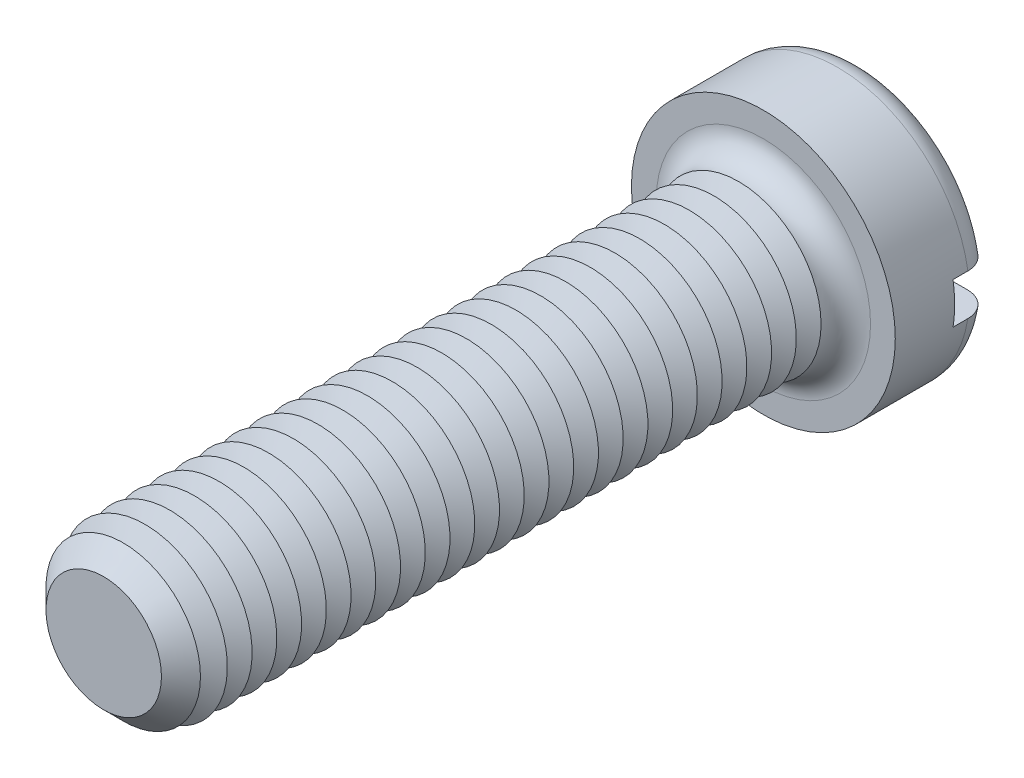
ISO-10303-21;
HEADER;
FILE_DESCRIPTION(('STEP AP214'),'2;1');
FILE_NAME('part.step','',(''),(''),'','','');
FILE_SCHEMA(('AUTOMOTIVE_DESIGN { 1 0 10303 214 1 1 1 1 }'));
ENDSEC;
DATA;
#1=APPLICATION_CONTEXT('core data for automotive mechanical design processes');
#2=APPLICATION_PROTOCOL_DEFINITION('international standard','automotive_design',2000,#1);
#3=PRODUCT_CONTEXT('',#1,'mechanical');
#4=PRODUCT('Part','Part','',(#3));
#5=PRODUCT_RELATED_PRODUCT_CATEGORY('part','',(#4));
#6=PRODUCT_DEFINITION_FORMATION('','',#4);
#7=PRODUCT_DEFINITION_CONTEXT('part definition',#1,'design');
#8=PRODUCT_DEFINITION('design','',#6,#7);
#9=PRODUCT_DEFINITION_SHAPE('','',#8);
#10=(LENGTH_UNIT() NAMED_UNIT(*) SI_UNIT(.MILLI.,.METRE.));
#11=(NAMED_UNIT(*) PLANE_ANGLE_UNIT() SI_UNIT($,.RADIAN.));
#12=(NAMED_UNIT(*) SI_UNIT($,.STERADIAN.) SOLID_ANGLE_UNIT());
#13=UNCERTAINTY_MEASURE_WITH_UNIT(LENGTH_MEASURE(1.E-05),#10,'distance_accuracy_value','');
#14=(GEOMETRIC_REPRESENTATION_CONTEXT(3) GLOBAL_UNCERTAINTY_ASSIGNED_CONTEXT((#13)) GLOBAL_UNIT_ASSIGNED_CONTEXT((#10,
#11,#12)) REPRESENTATION_CONTEXT('',''));
#15=CARTESIAN_POINT('',(0.,0.,0.));
#16=DIRECTION('',(0.,0.,1.));
#17=DIRECTION('',(1.,0.,0.));
#18=AXIS2_PLACEMENT_3D('',#15,#16,#17);
#19=CARTESIAN_POINT('',(0.,0.,-6.));
#20=DIRECTION('',(0.,0.,1.));
#21=DIRECTION('',(1.,0.,0.));
#22=AXIS2_PLACEMENT_3D('',#19,#20,#21);
#23=PLANE('',#22);
#24=CARTESIAN_POINT('',(0.,0.,-6.));
#25=DIRECTION('',(0.,0.,1.));
#26=DIRECTION('',(1.,0.,0.));
#27=AXIS2_PLACEMENT_3D('',#24,#25,#26);
#28=CIRCLE('',#27,6.5);
#29=CARTESIAN_POINT('',(-6.37867541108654,1.25,-6.));
#30=VERTEX_POINT('',#29);
#31=CARTESIAN_POINT('',(6.37867541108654,1.25,-6.));
#32=VERTEX_POINT('',#31);
#33=EDGE_CURVE('E116',#30,#32,#28,.F.);
#34=ORIENTED_EDGE('',*,*,#33,.T.);
#35=DIRECTION('',(1.,0.,0.));
#36=VECTOR('',#35,1.);
#37=CARTESIAN_POINT('',(-8.,1.25,-6.));
#38=LINE('',#37,#36);
#39=EDGE_CURVE('E111',#30,#32,#38,.T.);
#40=ORIENTED_EDGE('',*,*,#39,.F.);
#41=EDGE_LOOP('',(#34,#40));
#42=FACE_BOUND('',#41,.T.);
#43=ADVANCED_FACE('F39',(#42),#23,.F.);
#44=CARTESIAN_POINT('',(0.,0.,-4.5));
#45=DIRECTION('',(0.,0.,1.));
#46=DIRECTION('',(1.,0.,0.));
#47=AXIS2_PLACEMENT_3D('',#44,#45,#46);
#48=TOROIDAL_SURFACE('',#47,6.5,1.5);
#49=CARTESIAN_POINT('',(-7.63778128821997,1.25,-5.34492908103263));
#50=CARTESIAN_POINT('',(-7.58949199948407,1.25,-5.41482553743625));
#51=CARTESIAN_POINT('',(-7.53520056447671,1.25,-5.48065698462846));
#52=CARTESIAN_POINT('',(-7.41624971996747,1.25,-5.60228223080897));
#53=CARTESIAN_POINT('',(-7.35157642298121,1.25,-5.65806236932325));
#54=CARTESIAN_POINT('',(-7.21387612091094,1.25,-5.75795436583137));
#55=CARTESIAN_POINT('',(-7.14085828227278,1.25,-5.80207885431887));
#56=CARTESIAN_POINT('',(-6.98853766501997,1.25,-5.87758013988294));
#57=CARTESIAN_POINT('',(-6.90923642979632,1.25,-5.90896005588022));
#58=CARTESIAN_POINT('',(-6.74565677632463,1.25,-5.95849861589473));
#59=CARTESIAN_POINT('',(-6.66133328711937,1.25,-5.97650838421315));
#60=CARTESIAN_POINT('',(-6.49086565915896,1.25,-5.99833509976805));
#61=CARTESIAN_POINT('',(-6.40472129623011,1.25,-6.00215028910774));
#62=CARTESIAN_POINT('',(-6.23174891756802,1.25,-5.99550457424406));
#63=CARTESIAN_POINT('',(-6.14492874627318,1.25,-5.98483870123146));
#64=CARTESIAN_POINT('',(-5.97427268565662,1.25,-5.94920077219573));
#65=CARTESIAN_POINT('',(-5.89043699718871,1.25,-5.92422775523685));
#66=CARTESIAN_POINT('',(-5.72747580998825,1.25,-5.86041051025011));
#67=CARTESIAN_POINT('',(-5.64839123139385,1.25,-5.8214616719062));
#68=CARTESIAN_POINT('',(-5.49793182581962,1.25,-5.73076137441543));
#69=CARTESIAN_POINT('',(-5.42655700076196,1.25,-5.6790099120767));
#70=CARTESIAN_POINT('',(-5.29410028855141,1.25,-5.56444713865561));
#71=CARTESIAN_POINT('',(-5.23295591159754,1.25,-5.50170815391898));
#72=CARTESIAN_POINT('',(-5.12236155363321,1.25,-5.36664720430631));
#73=CARTESIAN_POINT('',(-5.07291010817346,1.25,-5.29432644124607));
#74=CARTESIAN_POINT('',(-4.98836421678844,1.25,-5.14389152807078));
#75=CARTESIAN_POINT('',(-4.95296843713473,1.25,-5.0659468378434));
#76=CARTESIAN_POINT('',(-4.89620356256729,1.25,-4.90510804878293));
#77=CARTESIAN_POINT('',(-4.87483169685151,1.25,-4.82221493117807));
#78=CARTESIAN_POINT('',(-4.8472995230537,1.25,-4.65636387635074));
#79=CARTESIAN_POINT('',(-4.84072446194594,1.25,-4.57347463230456));
#80=CARTESIAN_POINT('',(-4.84179430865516,1.25,-4.40779255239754));
#81=CARTESIAN_POINT('',(-4.84943782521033,1.25,-4.32499970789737));
#82=CARTESIAN_POINT('',(-4.87846819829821,1.25,-4.16301415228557));
#83=CARTESIAN_POINT('',(-4.89966978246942,1.25,-4.08378809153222));
#84=CARTESIAN_POINT('',(-4.95491528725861,1.25,-3.92995334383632));
#85=CARTESIAN_POINT('',(-4.98895983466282,1.25,-3.85534488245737));
#86=CARTESIAN_POINT('',(-5.06928242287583,1.25,-3.71183790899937));
#87=CARTESIAN_POINT('',(-5.11570495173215,1.25,-3.64302036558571));
#88=CARTESIAN_POINT('',(-5.21915370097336,1.25,-3.51388372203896));
#89=CARTESIAN_POINT('',(-5.27618132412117,1.25,-3.45356574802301));
#90=CARTESIAN_POINT('',(-5.40090076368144,1.25,-3.34137671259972));
#91=CARTESIAN_POINT('',(-5.46884305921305,1.25,-3.28978408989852));
#92=CARTESIAN_POINT('',(-5.61225757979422,1.25,-3.19841811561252));
#93=CARTESIAN_POINT('',(-5.68773079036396,1.25,-3.15864631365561));
#94=CARTESIAN_POINT('',(-5.84602026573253,1.25,-3.09111626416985));
#95=CARTESIAN_POINT('',(-5.92896901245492,1.25,-3.06366820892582));
#96=CARTESIAN_POINT('',(-6.09827849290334,1.25,-3.02294686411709));
#97=CARTESIAN_POINT('',(-6.18463944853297,1.25,-3.00967449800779));
#98=CARTESIAN_POINT('',(-6.35914138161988,1.25,-2.99765063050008));
#99=CARTESIAN_POINT('',(-6.4472913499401,1.25,-2.99902877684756));
#100=CARTESIAN_POINT('',(-6.62209547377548,1.25,-3.01665363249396));
#101=CARTESIAN_POINT('',(-6.70874965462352,1.25,-3.03290008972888));
#102=CARTESIAN_POINT('',(-6.87754008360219,1.25,-3.07975247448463));
#103=CARTESIAN_POINT('',(-6.95969991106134,1.25,-3.11027336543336));
#104=CARTESIAN_POINT('',(-7.11762200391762,1.25,-3.18486653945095));
#105=CARTESIAN_POINT('',(-7.19338469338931,1.25,-3.22893792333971));
#106=CARTESIAN_POINT('',(-7.33522754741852,1.25,-3.32873457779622));
#107=CARTESIAN_POINT('',(-7.40142768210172,1.25,-3.38428930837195));
#108=CARTESIAN_POINT('',(-7.52338344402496,1.25,-3.50587739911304));
#109=CARTESIAN_POINT('',(-7.5791399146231,1.25,-3.57190991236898));
#110=CARTESIAN_POINT('',(-7.67774856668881,1.25,-3.71151097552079));
#111=CARTESIAN_POINT('',(-7.72078137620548,1.25,-3.7849519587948));
#112=CARTESIAN_POINT('',(-7.79373860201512,1.25,-3.93807617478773));
#113=CARTESIAN_POINT('',(-7.82366445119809,1.25,-4.01775872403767));
#114=CARTESIAN_POINT('',(-7.86922494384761,1.25,-4.1801114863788));
#115=CARTESIAN_POINT('',(-7.88502105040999,1.25,-4.26273642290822));
#116=CARTESIAN_POINT('',(-7.90243332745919,1.25,-4.42948977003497));
#117=CARTESIAN_POINT('',(-7.90404643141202,1.25,-4.51361850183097));
#118=CARTESIAN_POINT('',(-7.89306914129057,1.25,-4.68049925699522));
#119=CARTESIAN_POINT('',(-7.88055163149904,1.25,-4.76325613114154));
#120=CARTESIAN_POINT('',(-7.84181179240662,1.25,-4.92542124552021));
#121=CARTESIAN_POINT('',(-7.81560657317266,1.25,-5.00483353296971));
#122=CARTESIAN_POINT('',(-7.76329893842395,1.25,-5.12766777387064));
#123=CARTESIAN_POINT('',(-7.74127773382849,1.25,-5.17287245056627));
#124=CARTESIAN_POINT('',(-7.69279783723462,1.25,-5.26083500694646));
#125=CARTESIAN_POINT('',(-7.66633917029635,1.25,-5.30359290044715));
#126=CARTESIAN_POINT('',(-7.63778128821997,1.25,-5.34492908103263));
#127=B_SPLINE_CURVE_WITH_KNOTS('',3,(#49,#50,#51,#52,#53,#54,#55,#56,#57,#58,#59,#60,#61,#62,
#63,#64,#65,#66,#67,#68,#69,#70,#71,#72,#73,#74,#75,#76,#77,#78,#79,#80,#81,#82,#83,#84,#85,#86,
#87,#88,#89,#90,#91,#92,#93,#94,#95,#96,#97,#98,#99,#100,#101,#102,#103,#104,#105,#106,#107,
#108,#109,#110,#111,#112,#113,#114,#115,#116,#117,#118,#119,#120,#121,#122,#123,#124,#125,#126),
.UNSPECIFIED.,.T.,.F.,(4,2,2,2,2,2,2,2,2,2,2,2,2,2,2,2,2,2,2,2,2,2,2,2,2,2,2,2,2,2,2,2,2,2,2,2,
2,2,4),(0.,0.254678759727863,0.509701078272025,0.764445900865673,1.01912834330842,
1.27660578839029,1.53411511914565,1.7953075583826,2.05651754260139,2.31972495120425,
2.58293242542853,2.84446831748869,3.10597143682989,3.36151874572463,3.61701554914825,
3.86525656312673,4.11347328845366,4.35836855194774,4.60327576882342,4.8511774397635,
5.0991119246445,5.35387584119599,5.60867314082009,5.86956650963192,6.13047687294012,
6.39369803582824,6.65691473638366,6.91858297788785,7.18023385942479,7.43824706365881,
7.69623942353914,7.95037087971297,8.20447454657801,8.45563599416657,8.70685174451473,
8.95677764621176,9.20639187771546,9.35700761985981,9.50762251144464),.UNSPECIFIED.);
#128=CARTESIAN_POINT('',(-7.90174031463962,1.25,-4.50000000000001));
#129=VERTEX_POINT('',#128);
#130=EDGE_CURVE('E384',#129,#30,#127,.T.);
#131=ORIENTED_EDGE('',*,*,#130,.F.);
#132=CARTESIAN_POINT('',(0.,0.,-4.5));
#133=DIRECTION('',(0.,0.,1.));
#134=DIRECTION('',(1.,0.,0.));
#135=AXIS2_PLACEMENT_3D('',#132,#133,#134);
#136=CIRCLE('',#135,8.);
#137=CARTESIAN_POINT('',(7.90174031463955,1.25,-4.5));
#138=VERTEX_POINT('',#137);
#139=EDGE_CURVE('E124',#138,#129,#136,.T.);
#140=ORIENTED_EDGE('',*,*,#139,.F.);
#141=CARTESIAN_POINT('',(4.95236709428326,1.25,-5.05808354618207));
#142=CARTESIAN_POINT('',(4.98477386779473,1.25,-5.13646278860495));
#143=CARTESIAN_POINT('',(5.02397623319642,1.25,-5.21210974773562));
#144=CARTESIAN_POINT('',(5.11464829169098,1.25,-5.35575180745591));
#145=CARTESIAN_POINT('',(5.16613670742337,1.25,-5.42373499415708));
#146=CARTESIAN_POINT('',(5.27963080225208,1.25,-5.55005899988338));
#147=CARTESIAN_POINT('',(5.34161871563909,1.25,-5.60841578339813));
#148=CARTESIAN_POINT('',(5.47431803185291,1.25,-5.71412381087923));
#149=CARTESIAN_POINT('',(5.545027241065,1.25,-5.76147781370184));
#150=CARTESIAN_POINT('',(5.69469818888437,1.25,-5.84486022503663));
#151=CARTESIAN_POINT('',(5.77379661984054,1.25,-5.88064336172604));
#152=CARTESIAN_POINT('',(5.93682776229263,1.25,-5.93863952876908));
#153=CARTESIAN_POINT('',(6.02076112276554,1.25,-5.96085073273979));
#154=CARTESIAN_POINT('',(6.19235911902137,1.25,-5.99130732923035));
#155=CARTESIAN_POINT('',(6.2800597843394,1.25,-5.99935025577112));
#156=CARTESIAN_POINT('',(6.45556807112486,1.25,-6.00057400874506));
#157=CARTESIAN_POINT('',(6.54337569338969,1.25,-5.99375472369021));
#158=CARTESIAN_POINT('',(6.71642471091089,1.25,-5.96539034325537));
#159=CARTESIAN_POINT('',(6.8016703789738,1.25,-5.94387137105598));
#160=CARTESIAN_POINT('',(6.96726399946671,1.25,-5.8866508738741));
#161=CARTESIAN_POINT('',(7.04761223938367,1.25,-5.85095018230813));
#162=CARTESIAN_POINT('',(7.2000703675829,1.25,-5.7668235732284));
#163=CARTESIAN_POINT('',(7.27226868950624,1.25,-5.71855796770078));
#164=CARTESIAN_POINT('',(7.40737382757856,1.25,-5.61041520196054));
#165=CARTESIAN_POINT('',(7.47028138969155,1.25,-5.55053897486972));
#166=CARTESIAN_POINT('',(7.5840004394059,1.25,-5.42185995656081));
#167=CARTESIAN_POINT('',(7.63498189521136,1.25,-5.35320736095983));
#168=CARTESIAN_POINT('',(7.72451646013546,1.25,-5.20822613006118));
#169=CARTESIAN_POINT('',(7.76307051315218,1.25,-5.13189807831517));
#170=CARTESIAN_POINT('',(7.82615156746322,1.25,-4.97479919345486));
#171=CARTESIAN_POINT('',(7.85085353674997,1.25,-4.89409858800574));
#172=CARTESIAN_POINT('',(7.88624162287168,1.25,-4.72968126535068));
#173=CARTESIAN_POINT('',(7.89692844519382,1.25,-4.64596470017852));
#174=CARTESIAN_POINT('',(7.90393395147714,1.25,-4.47857496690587));
#175=CARTESIAN_POINT('',(7.900361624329,1.25,-4.39490633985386));
#176=CARTESIAN_POINT('',(7.8792027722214,1.25,-4.22936201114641));
#177=CARTESIAN_POINT('',(7.86161649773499,1.25,-4.14748627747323));
#178=CARTESIAN_POINT('',(7.81298565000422,1.25,-3.98793539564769));
#179=CARTESIAN_POINT('',(7.78195585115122,1.25,-3.91025574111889));
#180=CARTESIAN_POINT('',(7.70736418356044,1.25,-3.76116938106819));
#181=CARTESIAN_POINT('',(7.66380211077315,1.25,-3.68976277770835));
#182=CARTESIAN_POINT('',(7.56515173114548,1.25,-3.55480889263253));
#183=CARTESIAN_POINT('',(7.51000119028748,1.25,-3.49130712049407));
#184=CARTESIAN_POINT('',(7.38992820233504,1.25,-3.3743390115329));
#185=CARTESIAN_POINT('',(7.32500529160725,1.25,-3.32087315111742));
#186=CARTESIAN_POINT('',(7.18646521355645,1.25,-3.22483712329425));
#187=CARTESIAN_POINT('',(7.11275872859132,1.25,-3.18239583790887));
#188=CARTESIAN_POINT('',(6.95934489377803,1.25,-3.11028530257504));
#189=CARTESIAN_POINT('',(6.87963710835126,1.25,-3.08061698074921));
#190=CARTESIAN_POINT('',(6.71523243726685,1.25,-3.03442872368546));
#191=CARTESIAN_POINT('',(6.63047940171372,1.25,-3.0181086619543));
#192=CARTESIAN_POINT('',(6.45944163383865,1.25,-2.99971307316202));
#193=CARTESIAN_POINT('',(6.37315677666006,1.25,-2.99763871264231));
#194=CARTESIAN_POINT('',(6.20021063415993,1.25,-3.00779604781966));
#195=CARTESIAN_POINT('',(6.11356117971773,1.25,-3.02022976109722));
#196=CARTESIAN_POINT('',(5.94354092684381,1.25,-3.05935975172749));
#197=CARTESIAN_POINT('',(5.86017035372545,1.25,-3.08605700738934));
#198=CARTESIAN_POINT('',(5.69848536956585,1.25,-3.15322746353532));
#199=CARTESIAN_POINT('',(5.62021039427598,1.25,-3.1937956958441));
#200=CARTESIAN_POINT('',(5.47164170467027,1.25,-3.28758816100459));
#201=CARTESIAN_POINT('',(5.40134797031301,1.25,-3.3408123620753));
#202=CARTESIAN_POINT('',(5.27136483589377,1.25,-3.45806317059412));
#203=CARTESIAN_POINT('',(5.21160120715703,1.25,-3.52200740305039));
#204=CARTESIAN_POINT('',(5.10396941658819,1.25,-3.65922833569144));
#205=CARTESIAN_POINT('',(5.05609917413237,1.25,-3.73250340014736));
#206=CARTESIAN_POINT('',(4.97487058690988,1.25,-3.8844714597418));
#207=CARTESIAN_POINT('',(4.94119529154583,1.25,-3.96299495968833));
#208=CARTESIAN_POINT('',(4.88793322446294,1.25,-4.12470694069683));
#209=CARTESIAN_POINT('',(4.86834741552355,1.25,-4.20789574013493));
#210=CARTESIAN_POINT('',(4.84433446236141,1.25,-4.3740749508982));
#211=CARTESIAN_POINT('',(4.83950391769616,1.25,-4.45700748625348));
#212=CARTESIAN_POINT('',(4.84404021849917,1.25,-4.62240731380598));
#213=CARTESIAN_POINT('',(4.85338770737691,1.25,-4.70487508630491));
#214=CARTESIAN_POINT('',(4.87895619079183,1.25,-4.83246978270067));
#215=CARTESIAN_POINT('',(4.89056704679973,1.25,-4.87856970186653));
#216=CARTESIAN_POINT('',(4.91819711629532,1.25,-4.96942661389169));
#217=CARTESIAN_POINT('',(4.93421619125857,1.25,-5.01418364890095));
#218=CARTESIAN_POINT('',(4.95236709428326,1.25,-5.05808354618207));
#219=B_SPLINE_CURVE_WITH_KNOTS('',3,(#141,#142,#143,#144,#145,#146,#147,#148,#149,#150,#151,
#152,#153,#154,#155,#156,#157,#158,#159,#160,#161,#162,#163,#164,#165,#166,#167,#168,#169,#170,
#171,#172,#173,#174,#175,#176,#177,#178,#179,#180,#181,#182,#183,#184,#185,#186,#187,#188,#189,
#190,#191,#192,#193,#194,#195,#196,#197,#198,#199,#200,#201,#202,#203,#204,#205,#206,#207,#208,
#209,#210,#211,#212,#213,#214,#215,#216,#217,#218),.UNSPECIFIED.,.T.,.F.,(4,2,2,2,2,2,2,2,2,2,2,
2,2,2,2,2,2,2,2,2,2,2,2,2,2,2,2,2,2,2,2,2,2,2,2,2,2,2,4),(0.,0.25426396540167,0.508917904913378,
0.763145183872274,1.01730864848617,1.27655188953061,1.53583000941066,1.79878406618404,
2.06174009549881,2.32423003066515,2.5867045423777,2.84598168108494,3.10523799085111,
3.36053725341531,3.61581712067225,3.8677953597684,4.11976091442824,4.36980428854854,
4.61984319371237,4.86960800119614,5.11937687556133,5.37052303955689,5.62168112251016,
5.87565515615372,6.12964764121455,6.38737709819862,6.64512765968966,6.90651052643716,
7.16791132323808,7.43114013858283,7.69436829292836,7.95565940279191,8.21690477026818,
8.47196060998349,8.72703387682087,8.97506819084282,9.22276418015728,9.36518087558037,
9.50759309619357),.UNSPECIFIED.);
#220=EDGE_CURVE('E386',#32,#138,#219,.T.);
#221=ORIENTED_EDGE('',*,*,#220,.F.);
#222=ORIENTED_EDGE('',*,*,#33,.F.);
#223=EDGE_LOOP('',(#131,#140,#221,#222));
#224=FACE_BOUND('',#223,.T.);
#225=ADVANCED_FACE('F368',(#224),#48,.T.);
#226=CARTESIAN_POINT('',(0.,0.,-6.));
#227=DIRECTION('',(0.,0.,1.));
#228=DIRECTION('',(1.,0.,0.));
#229=AXIS2_PLACEMENT_3D('',#226,#227,#228);
#230=CYLINDRICAL_SURFACE('',#229,8.);
#231=DIRECTION('',(0.,0.,1.));
#232=VECTOR('',#231,1.);
#233=CARTESIAN_POINT('',(7.90174031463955,1.25,-6.));
#234=LINE('',#233,#232);
#235=CARTESIAN_POINT('',(7.90174031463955,1.25,-3.6));
#236=VERTEX_POINT('',#235);
#237=EDGE_CURVE('E402',#138,#236,#234,.T.);
#238=ORIENTED_EDGE('',*,*,#237,.F.);
#239=ORIENTED_EDGE('',*,*,#139,.T.);
#240=DIRECTION('',(0.,0.,1.));
#241=VECTOR('',#240,1.);
#242=CARTESIAN_POINT('',(-7.90174031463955,1.25,-6.));
#243=LINE('',#242,#241);
#244=CARTESIAN_POINT('',(-7.90174031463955,1.25,-3.6));
#245=VERTEX_POINT('',#244);
#246=EDGE_CURVE('E63',#245,#129,#243,.F.);
#247=ORIENTED_EDGE('',*,*,#246,.F.);
#248=CARTESIAN_POINT('',(0.,0.,-3.6));
#249=DIRECTION('',(0.,0.,-1.));
#250=DIRECTION('',(-1.,0.,0.));
#251=AXIS2_PLACEMENT_3D('',#248,#249,#250);
#252=CIRCLE('',#251,8.);
#253=CARTESIAN_POINT('',(-7.90174031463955,-1.25,-3.6));
#254=VERTEX_POINT('',#253);
#255=EDGE_CURVE('E43',#245,#254,#252,.F.);
#256=ORIENTED_EDGE('',*,*,#255,.T.);
#257=DIRECTION('',(0.,0.,1.));
#258=VECTOR('',#257,1.);
#259=CARTESIAN_POINT('',(-7.90174031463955,-1.25,-6.));
#260=LINE('',#259,#258);
#261=CARTESIAN_POINT('',(-7.9017403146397,-1.25,-4.49999999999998));
#262=VERTEX_POINT('',#261);
#263=EDGE_CURVE('E399',#262,#254,#260,.T.);
#264=ORIENTED_EDGE('',*,*,#263,.F.);
#265=CARTESIAN_POINT('',(7.90174031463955,-1.25,-4.5));
#266=VERTEX_POINT('',#265);
#267=EDGE_CURVE('E126',#262,#266,#136,.T.);
#268=ORIENTED_EDGE('',*,*,#267,.T.);
#269=DIRECTION('',(0.,0.,1.));
#270=VECTOR('',#269,1.);
#271=CARTESIAN_POINT('',(7.90174031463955,-1.25,-6.));
#272=LINE('',#271,#270);
#273=CARTESIAN_POINT('',(7.90174031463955,-1.25,-3.6));
#274=VERTEX_POINT('',#273);
#275=EDGE_CURVE('E55',#274,#266,#272,.F.);
#276=ORIENTED_EDGE('',*,*,#275,.F.);
#277=EDGE_CURVE('E11',#274,#236,#252,.F.);
#278=ORIENTED_EDGE('',*,*,#277,.T.);
#279=EDGE_LOOP('',(#238,#239,#247,#256,#264,#268,#276,#278));
#280=FACE_BOUND('',#279,.T.);
#281=CARTESIAN_POINT('',(0.,0.,0.));
#282=DIRECTION('',(0.,0.,1.));
#283=DIRECTION('',(1.,0.,0.));
#284=AXIS2_PLACEMENT_3D('',#281,#282,#283);
#285=CIRCLE('',#284,8.);
#286=CARTESIAN_POINT('',(8.,0.,0.));
#287=VERTEX_POINT('',#286);
#288=EDGE_CURVE('E405',#287,#287,#285,.T.);
#289=ORIENTED_EDGE('',*,*,#288,.F.);
#290=EDGE_LOOP('',(#289));
#291=FACE_BOUND('',#290,.T.);
#292=ADVANCED_FACE('F364',(#280,#291),#230,.T.);
#293=CARTESIAN_POINT('',(6.37867541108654,-1.25,-6.));
#294=VERTEX_POINT('',#293);
#295=CARTESIAN_POINT('',(-6.37867541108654,-1.25,-6.));
#296=VERTEX_POINT('',#295);
#297=EDGE_CURVE('E109',#294,#296,#28,.F.);
#298=ORIENTED_EDGE('',*,*,#297,.T.);
#299=DIRECTION('',(-1.,0.,0.));
#300=VECTOR('',#299,1.);
#301=CARTESIAN_POINT('',(-8.,-1.25,-6.));
#302=LINE('',#301,#300);
#303=EDGE_CURVE('E96',#294,#296,#302,.T.);
#304=ORIENTED_EDGE('',*,*,#303,.F.);
#305=EDGE_LOOP('',(#298,#304));
#306=FACE_BOUND('',#305,.T.);
#307=ADVANCED_FACE('F108',(#306),#23,.F.);
#308=CARTESIAN_POINT('',(0.,0.,0.));
#309=DIRECTION('',(0.,0.,1.));
#310=DIRECTION('',(1.,0.,0.));
#311=AXIS2_PLACEMENT_3D('',#308,#309,#310);
#312=PLANE('',#311);
#313=CARTESIAN_POINT('',(0.,0.,0.));
#314=DIRECTION('',(0.,0.,1.));
#315=DIRECTION('',(1.,0.,0.));
#316=AXIS2_PLACEMENT_3D('',#313,#314,#315);
#317=CIRCLE('',#316,6.5);
#318=CARTESIAN_POINT('',(6.5,0.,0.));
#319=VERTEX_POINT('',#318);
#320=EDGE_CURVE('E115',#319,#319,#317,.F.);
#321=ORIENTED_EDGE('',*,*,#320,.T.);
#322=EDGE_LOOP('',(#321));
#323=FACE_BOUND('',#322,.T.);
#324=ORIENTED_EDGE('',*,*,#288,.T.);
#325=EDGE_LOOP('',(#324));
#326=FACE_BOUND('',#325,.T.);
#327=ADVANCED_FACE('F363',(#323,#326),#312,.T.);
#328=CARTESIAN_POINT('',(-7.63778128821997,-1.25,-5.34492908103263));
#329=CARTESIAN_POINT('',(-7.68527581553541,-1.25,-5.27616964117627));
#330=CARTESIAN_POINT('',(-7.72703224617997,-1.25,-5.20337764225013));
#331=CARTESIAN_POINT('',(-7.79778035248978,-1.25,-5.05176511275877));
#332=CARTESIAN_POINT('',(-7.82675823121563,-1.25,-4.97293817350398));
#333=CARTESIAN_POINT('',(-7.87103239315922,-1.25,-4.81153865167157));
#334=CARTESIAN_POINT('',(-7.8863313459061,-1.25,-4.72896680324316));
#335=CARTESIAN_POINT('',(-7.90278562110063,-1.25,-4.56244566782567));
#336=CARTESIAN_POINT('',(-7.90394420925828,-1.25,-4.4784967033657));
#337=CARTESIAN_POINT('',(-7.89211470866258,-1.25,-4.31190980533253));
#338=CARTESIAN_POINT('',(-7.87917806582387,-1.25,-4.22926821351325));
#339=CARTESIAN_POINT('',(-7.8396278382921,-1.25,-4.06732477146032));
#340=CARTESIAN_POINT('',(-7.81301388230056,-1.25,-3.98802301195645));
#341=CARTESIAN_POINT('',(-7.74686575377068,-1.25,-3.83490116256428));
#342=CARTESIAN_POINT('',(-7.70731700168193,-1.25,-3.76108737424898));
#343=CARTESIAN_POINT('',(-7.61647675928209,-1.25,-3.62108231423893));
#344=CARTESIAN_POINT('',(-7.56518496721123,-1.25,-3.55489123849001));
#345=CARTESIAN_POINT('',(-7.45192141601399,-1.25,-3.43145488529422));
#346=CARTESIAN_POINT('',(-7.3898717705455,-1.25,-3.37428109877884));
#347=CARTESIAN_POINT('',(-7.25715883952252,-1.25,-3.27100737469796));
#348=CARTESIAN_POINT('',(-7.18649507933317,-1.25,-3.22490804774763));
#349=CARTESIAN_POINT('',(-7.03760898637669,-1.25,-3.14445316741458));
#350=CARTESIAN_POINT('',(-6.95930204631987,-1.25,-3.1102542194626));
#351=CARTESIAN_POINT('',(-6.79811453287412,-1.25,-3.05526915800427));
#352=CARTESIAN_POINT('',(-6.71523359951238,-1.25,-3.03448410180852));
#353=CARTESIAN_POINT('',(-6.5459165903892,-1.25,-3.006592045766));
#354=CARTESIAN_POINT('',(-6.45944575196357,-1.25,-2.99969602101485));
#355=CARTESIAN_POINT('',(-6.28655568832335,-1.25,-3.00032465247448));
#356=CARTESIAN_POINT('',(-6.20013646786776,-1.25,-3.00785047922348));
#357=CARTESIAN_POINT('',(-6.02865505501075,-1.25,-3.03725742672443));
#358=CARTESIAN_POINT('',(-5.94362352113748,-1.25,-3.05931758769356));
#359=CARTESIAN_POINT('',(-5.77844448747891,-1.25,-3.11735373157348));
#360=CARTESIAN_POINT('',(-5.69829723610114,-1.25,-3.15333042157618));
#361=CARTESIAN_POINT('',(-5.54495924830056,-1.25,-3.23837037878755));
#362=CARTESIAN_POINT('',(-5.47178958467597,-1.25,-3.28747168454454));
#363=CARTESIAN_POINT('',(-5.33486536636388,-1.25,-3.39741183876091));
#364=CARTESIAN_POINT('',(-5.27111040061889,-1.25,-3.45825017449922));
#365=CARTESIAN_POINT('',(-5.15579778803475,-1.25,-3.58914722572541));
#366=CARTESIAN_POINT('',(-5.10409113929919,-1.25,-3.65907455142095));
#367=CARTESIAN_POINT('',(-5.01353659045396,-1.25,-3.8068142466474));
#368=CARTESIAN_POINT('',(-4.97468647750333,-1.25,-3.88462525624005));
#369=CARTESIAN_POINT('',(-4.91208858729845,-1.25,-4.04366636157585));
#370=CARTESIAN_POINT('',(-4.88795969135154,-1.25,-4.12474643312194));
#371=CARTESIAN_POINT('',(-4.85404909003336,-1.25,-4.28985038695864));
#372=CARTESIAN_POINT('',(-4.84426486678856,-1.25,-4.37387374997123));
#373=CARTESIAN_POINT('',(-4.83946276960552,-1.25,-4.54023897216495));
#374=CARTESIAN_POINT('',(-4.8440833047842,-1.25,-4.62257060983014));
#375=CARTESIAN_POINT('',(-4.86713763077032,-1.25,-4.78527148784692));
#376=CARTESIAN_POINT('',(-4.88557092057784,-1.25,-4.86564079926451));
#377=CARTESIAN_POINT('',(-4.9355229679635,-1.25,-5.02189555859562));
#378=CARTESIAN_POINT('',(-4.9669975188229,-1.25,-5.09779517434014));
#379=CARTESIAN_POINT('',(-5.04199393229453,-1.25,-5.24338322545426));
#380=CARTESIAN_POINT('',(-5.0855168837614,-1.25,-5.31307109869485));
#381=CARTESIAN_POINT('',(-5.18427540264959,-1.25,-5.44580979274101));
#382=CARTESIAN_POINT('',(-5.2397318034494,-1.25,-5.50869620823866));
#383=CARTESIAN_POINT('',(-5.36015301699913,-1.25,-5.62458635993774));
#384=CARTESIAN_POINT('',(-5.42511919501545,-1.25,-5.67758867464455));
#385=CARTESIAN_POINT('',(-5.56469412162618,-1.25,-5.7737610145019));
#386=CARTESIAN_POINT('',(-5.6395232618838,-1.25,-5.81661133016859));
#387=CARTESIAN_POINT('',(-5.79521544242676,-1.25,-5.8894110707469));
#388=CARTESIAN_POINT('',(-5.8760791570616,-1.25,-5.91935905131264));
#389=CARTESIAN_POINT('',(-6.04317815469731,-1.25,-5.9660059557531));
#390=CARTESIAN_POINT('',(-6.12948555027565,-1.25,-5.98244700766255));
#391=CARTESIAN_POINT('',(-6.30363462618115,-1.25,-6.00064866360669));
#392=CARTESIAN_POINT('',(-6.39147629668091,-1.25,-6.00240936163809));
#393=CARTESIAN_POINT('',(-6.5664192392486,-1.25,-5.9911248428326));
#394=CARTESIAN_POINT('',(-6.653518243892,-1.25,-5.9780442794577));
#395=CARTESIAN_POINT('',(-6.82426167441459,-1.25,-5.93729204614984));
#396=CARTESIAN_POINT('',(-6.90790538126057,-1.25,-5.90961735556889));
#397=CARTESIAN_POINT('',(-7.06846412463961,-1.25,-5.84071272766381));
#398=CARTESIAN_POINT('',(-7.14543542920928,-1.25,-5.79961377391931));
#399=CARTESIAN_POINT('',(-7.29116896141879,-1.25,-5.70491210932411));
#400=CARTESIAN_POINT('',(-7.35994165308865,-1.25,-5.65132560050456));
#401=CARTESIAN_POINT('',(-7.46362894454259,-1.25,-5.55509815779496));
#402=CARTESIAN_POINT('',(-7.50165191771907,-1.25,-5.51575032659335));
#403=CARTESIAN_POINT('',(-7.57319530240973,-1.25,-5.43315308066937));
#404=CARTESIAN_POINT('',(-7.60671575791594,-1.25,-5.38990370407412));
#405=CARTESIAN_POINT('',(-7.63778128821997,-1.25,-5.34492908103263));
#406=B_SPLINE_CURVE_WITH_KNOTS('',3,(#328,#329,#330,#331,#332,#333,#334,#335,#336,#337,#338,
#339,#340,#341,#342,#343,#344,#345,#346,#347,#348,#349,#350,#351,#352,#353,#354,#355,#356,#357,
#358,#359,#360,#361,#362,#363,#364,#365,#366,#367,#368,#369,#370,#371,#372,#373,#374,#375,#376,
#377,#378,#379,#380,#381,#382,#383,#384,#385,#386,#387,#388,#389,#390,#391,#392,#393,#394,#395,
#396,#397,#398,#399,#400,#401,#402,#403,#404,#405),.UNSPECIFIED.,.T.,.F.,(4,2,2,2,2,2,2,2,2,2,2,
2,2,2,2,2,2,2,2,2,2,2,2,2,2,2,2,2,2,2,2,2,2,2,2,2,2,2,4),(0.,0.250506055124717,
0.501281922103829,0.752008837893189,1.00267784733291,1.25243500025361,1.50219893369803,
1.75224536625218,2.00229822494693,2.25424343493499,2.50620253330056,2.76136198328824,
3.01654154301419,3.27556891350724,3.53461730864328,3.79691797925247,4.05923197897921,
4.32231463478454,4.5853858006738,4.84500678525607,5.10458306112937,5.3571172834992,
5.60960717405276,5.85581050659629,6.10200490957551,6.34737151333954,6.59276029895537,
6.84315522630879,7.09358613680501,7.35108485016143,7.60861238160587,7.87094926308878,
8.13328446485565,8.39624576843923,8.65926152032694,8.91978401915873,9.17997036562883,
9.34382460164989,9.50767723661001),.UNSPECIFIED.);
#407=EDGE_CURVE('E103',#296,#262,#406,.T.);
#408=ORIENTED_EDGE('',*,*,#407,.F.);
#409=ORIENTED_EDGE('',*,*,#297,.F.);
#410=CARTESIAN_POINT('',(4.95236709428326,-1.25,-5.05808354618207));
#411=CARTESIAN_POINT('',(4.92105512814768,-1.25,-4.98233216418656));
#412=CARTESIAN_POINT('',(4.89604361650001,-1.25,-4.90392040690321));
#413=CARTESIAN_POINT('',(4.85951223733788,-1.25,-4.74395758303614));
#414=CARTESIAN_POINT('',(4.8480045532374,-1.25,-4.66240375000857));
#415=CARTESIAN_POINT('',(4.83891469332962,-1.25,-4.49852199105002));
#416=CARTESIAN_POINT('',(4.84133145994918,-1.25,-4.41619412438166));
#417=CARTESIAN_POINT('',(4.8600038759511,-1.25,-4.25314313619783));
#418=CARTESIAN_POINT('',(4.87625705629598,-1.25,-4.17241973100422));
#419=CARTESIAN_POINT('',(4.92196554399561,-1.25,-4.01505032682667));
#420=CARTESIAN_POINT('',(4.95138456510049,-1.25,-3.93839376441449));
#421=CARTESIAN_POINT('',(5.02244158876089,-1.25,-3.79097367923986));
#422=CARTESIAN_POINT('',(5.06408092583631,-1.25,-3.72021080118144));
#423=CARTESIAN_POINT('',(5.15918188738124,-1.25,-3.5851203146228));
#424=CARTESIAN_POINT('',(5.21285223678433,-1.25,-3.5209397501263));
#425=CARTESIAN_POINT('',(5.32993512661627,-1.25,-3.40218700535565));
#426=CARTESIAN_POINT('',(5.39334903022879,-1.25,-3.34761617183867));
#427=CARTESIAN_POINT('',(5.5300552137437,-1.25,-3.24801679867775));
#428=CARTESIAN_POINT('',(5.60357647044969,-1.25,-3.20330242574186));
#429=CARTESIAN_POINT('',(5.75697062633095,-1.25,-3.1265687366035));
#430=CARTESIAN_POINT('',(5.83684424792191,-1.25,-3.09455086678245));
#431=CARTESIAN_POINT('',(6.00239031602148,-1.25,-3.04353393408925));
#432=CARTESIAN_POINT('',(6.08814636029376,-1.25,-3.02480570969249));
#433=CARTESIAN_POINT('',(6.26158564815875,-1.25,-3.00194915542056));
#434=CARTESIAN_POINT('',(6.34926896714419,-1.25,-2.997821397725));
#435=CARTESIAN_POINT('',(6.52441816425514,-1.25,-3.00435236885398));
#436=CARTESIAN_POINT('',(6.61188199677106,-1.25,-3.01506655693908));
#437=CARTESIAN_POINT('',(6.78373130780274,-1.25,-3.05116556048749));
#438=CARTESIAN_POINT('',(6.8681168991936,-1.25,-3.07654983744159));
#439=CARTESIAN_POINT('',(7.03056473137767,-1.25,-3.14105639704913));
#440=CARTESIAN_POINT('',(7.10867812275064,-1.25,-3.18004978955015));
#441=CARTESIAN_POINT('',(7.25711285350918,-1.25,-3.27078804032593));
#442=CARTESIAN_POINT('',(7.327434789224,-1.25,-3.32253192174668));
#443=CARTESIAN_POINT('',(7.45716954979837,-1.25,-3.4364775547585));
#444=CARTESIAN_POINT('',(7.51672925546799,-1.25,-3.49851206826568));
#445=CARTESIAN_POINT('',(7.62440498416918,-1.25,-3.63182557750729));
#446=CARTESIAN_POINT('',(7.67252193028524,-1.25,-3.70310382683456));
#447=CARTESIAN_POINT('',(7.75523498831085,-1.25,-3.8517825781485));
#448=CARTESIAN_POINT('',(7.79001407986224,-1.25,-3.92908131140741));
#449=CARTESIAN_POINT('',(7.84595474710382,-1.25,-4.08845836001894));
#450=CARTESIAN_POINT('',(7.86711715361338,-1.25,-4.1705363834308));
#451=CARTESIAN_POINT('',(7.89503817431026,-1.25,-4.3362768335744));
#452=CARTESIAN_POINT('',(7.90193595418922,-1.25,-4.41991584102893));
#453=CARTESIAN_POINT('',(7.90153623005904,-1.25,-4.58715860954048));
#454=CARTESIAN_POINT('',(7.89423915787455,-1.25,-4.67076237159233));
#455=CARTESIAN_POINT('',(7.86572271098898,-1.25,-4.83525080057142));
#456=CARTESIAN_POINT('',(7.84455307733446,-1.25,-4.91614410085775));
#457=CARTESIAN_POINT('',(7.78897430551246,-1.25,-5.0732444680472));
#458=CARTESIAN_POINT('',(7.75456511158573,-1.25,-5.1494515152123));
#459=CARTESIAN_POINT('',(7.67339923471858,-1.25,-5.29528903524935));
#460=CARTESIAN_POINT('',(7.62660424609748,-1.25,-5.36489817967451));
#461=CARTESIAN_POINT('',(7.52209201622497,-1.25,-5.49536318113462));
#462=CARTESIAN_POINT('',(7.4643743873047,-1.25,-5.55621872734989));
#463=CARTESIAN_POINT('',(7.33909994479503,-1.25,-5.66807257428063));
#464=CARTESIAN_POINT('',(7.27145672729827,-1.25,-5.71897407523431));
#465=CARTESIAN_POINT('',(7.12868060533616,-1.25,-5.80887807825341));
#466=CARTESIAN_POINT('',(7.0535472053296,-1.25,-5.84787979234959));
#467=CARTESIAN_POINT('',(6.89682225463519,-1.25,-5.91345911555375));
#468=CARTESIAN_POINT('',(6.81515596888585,-1.25,-5.93985808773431));
#469=CARTESIAN_POINT('',(6.64858434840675,-1.25,-5.97879449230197));
#470=CARTESIAN_POINT('',(6.56367874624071,-1.25,-5.99133077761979));
#471=CARTESIAN_POINT('',(6.39168259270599,-1.25,-6.00236627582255));
#472=CARTESIAN_POINT('',(6.30457835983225,-1.25,-6.00065255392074));
#473=CARTESIAN_POINT('',(6.13186422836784,-1.25,-5.98278857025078));
#474=CARTESIAN_POINT('',(6.04625438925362,-1.25,-5.96663773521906));
#475=CARTESIAN_POINT('',(5.87802521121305,-1.25,-5.92012173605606));
#476=CARTESIAN_POINT('',(5.79544617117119,-1.25,-5.88961066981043));
#477=CARTESIAN_POINT('',(5.63656223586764,-1.25,-5.81513349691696));
#478=CARTESIAN_POINT('',(5.56025908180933,-1.25,-5.77116367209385));
#479=CARTESIAN_POINT('',(5.4162607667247,-1.25,-5.67098882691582));
#480=CARTESIAN_POINT('',(5.34855795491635,-1.25,-5.61479480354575));
#481=CARTESIAN_POINT('',(5.22382615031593,-1.25,-5.49168804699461));
#482=CARTESIAN_POINT('',(5.16678340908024,-1.25,-5.42478932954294));
#483=CARTESIAN_POINT('',(5.08326589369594,-1.25,-5.3075481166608));
#484=CARTESIAN_POINT('',(5.05313168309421,-1.25,-5.25976959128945));
#485=CARTESIAN_POINT('',(4.99845900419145,-1.25,-5.16110869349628));
#486=CARTESIAN_POINT('',(4.9739204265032,-1.25,-5.11022638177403));
#487=CARTESIAN_POINT('',(4.95236709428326,-1.25,-5.05808354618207));
#488=B_SPLINE_CURVE_WITH_KNOTS('',3,(#410,#411,#412,#413,#414,#415,#416,#417,#418,#419,#420,
#421,#422,#423,#424,#425,#426,#427,#428,#429,#430,#431,#432,#433,#434,#435,#436,#437,#438,#439,
#440,#441,#442,#443,#444,#445,#446,#447,#448,#449,#450,#451,#452,#453,#454,#455,#456,#457,#458,
#459,#460,#461,#462,#463,#464,#465,#466,#467,#468,#469,#470,#471,#472,#473,#474,#475,#476,#477,
#478,#479,#480,#481,#482,#483,#484,#485,#486,#487),.UNSPECIFIED.,.T.,.F.,(4,2,2,2,2,2,2,2,2,2,2,
2,2,2,2,2,2,2,2,2,2,2,2,2,2,2,2,2,2,2,2,2,2,2,2,2,2,2,4),(0.,0.245701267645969,
0.491624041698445,0.737528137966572,0.983388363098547,1.22857510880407,1.47378864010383,
1.72364048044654,1.97352730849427,2.2304941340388,2.48749022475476,2.74958408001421,
3.01168820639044,3.2747743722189,3.53785088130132,3.79850056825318,4.05913029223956,
4.31587819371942,4.57260537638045,4.82567253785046,5.07872425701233,5.32929532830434,
5.57985877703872,5.82952869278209,6.07919966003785,6.32965199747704,6.58011322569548,
6.8329006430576,7.08570479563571,7.3419930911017,7.59830259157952,7.85844887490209,
8.11860548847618,8.38146435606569,8.64439590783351,8.90709189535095,9.16944670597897,
9.33857644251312,9.5077028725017),.UNSPECIFIED.);
#489=EDGE_CURVE('E92',#266,#294,#488,.T.);
#490=ORIENTED_EDGE('',*,*,#489,.F.);
#491=ORIENTED_EDGE('',*,*,#267,.F.);
#492=EDGE_LOOP('',(#408,#409,#490,#491));
#493=FACE_BOUND('',#492,.T.);
#494=ADVANCED_FACE('F113',(#493),#48,.T.);
#495=CARTESIAN_POINT('',(0.,0.,1.5));
#496=DIRECTION('',(0.,0.,1.));
#497=DIRECTION('',(1.,0.,0.));
#498=AXIS2_PLACEMENT_3D('',#495,#496,#497);
#499=TOROIDAL_SURFACE('',#498,6.5,1.5);
#500=ORIENTED_EDGE('',*,*,#320,.F.);
#501=EDGE_LOOP('',(#500));
#502=FACE_BOUND('',#501,.T.);
#503=CARTESIAN_POINT('',(0.,0.,1.5));
#504=DIRECTION('',(0.,0.,-1.));
#505=DIRECTION('',(-1.,0.,0.));
#506=AXIS2_PLACEMENT_3D('',#503,#504,#505);
#507=CIRCLE('',#506,5.);
#508=CARTESIAN_POINT('',(-5.,0.,1.5));
#509=VERTEX_POINT('',#508);
#510=EDGE_CURVE('E410',#509,#509,#507,.T.);
#511=ORIENTED_EDGE('',*,*,#510,.T.);
#512=EDGE_LOOP('',(#511));
#513=FACE_BOUND('',#512,.T.);
#514=ADVANCED_FACE('F356',(#502,#513),#499,.F.);
#515=CARTESIAN_POINT('',(0.,0.,2.25));
#516=DIRECTION('',(0.,0.,-1.));
#517=DIRECTION('',(-1.,0.,0.));
#518=AXIS2_PLACEMENT_3D('',#515,#516,#517);
#519=CONICAL_SURFACE('',#518,3.70096189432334,1.0471975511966);
#520=ORIENTED_EDGE('',*,*,#510,.F.);
#521=EDGE_LOOP('',(#520));
#522=FACE_BOUND('',#521,.T.);
#523=CARTESIAN_POINT('',(0.,0.,2.25));
#524=DIRECTION('',(0.,0.,-1.));
#525=DIRECTION('',(-1.,0.,0.));
#526=AXIS2_PLACEMENT_3D('',#523,#524,#525);
#527=CIRCLE('',#526,3.70096189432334);
#528=CARTESIAN_POINT('',(-3.70096189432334,0.,2.25));
#529=VERTEX_POINT('',#528);
#530=EDGE_CURVE('E416',#529,#529,#527,.T.);
#531=ORIENTED_EDGE('',*,*,#530,.T.);
#532=EDGE_LOOP('',(#531));
#533=FACE_BOUND('',#532,.T.);
#534=ADVANCED_FACE('F352',(#522,#533),#519,.T.);
#535=CARTESIAN_POINT('',(0.,0.,3.));
#536=DIRECTION('',(0.,0.,1.));
#537=DIRECTION('',(1.,0.,0.));
#538=AXIS2_PLACEMENT_3D('',#535,#536,#537);
#539=CONICAL_SURFACE('',#538,5.,1.0471975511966);
#540=ORIENTED_EDGE('',*,*,#530,.F.);
#541=EDGE_LOOP('',(#540));
#542=FACE_BOUND('',#541,.T.);
#543=CARTESIAN_POINT('',(0.,0.,3.));
#544=DIRECTION('',(0.,0.,-1.));
#545=DIRECTION('',(-1.,0.,0.));
#546=AXIS2_PLACEMENT_3D('',#543,#544,#545);
#547=CIRCLE('',#546,5.);
#548=CARTESIAN_POINT('',(-5.,0.,3.));
#549=VERTEX_POINT('',#548);
#550=EDGE_CURVE('E422',#549,#549,#547,.T.);
#551=ORIENTED_EDGE('',*,*,#550,.T.);
#552=EDGE_LOOP('',(#551));
#553=FACE_BOUND('',#552,.T.);
#554=ADVANCED_FACE('F348',(#542,#553),#539,.T.);
#555=CARTESIAN_POINT('',(0.,0.,3.75));
#556=DIRECTION('',(0.,0.,-1.));
#557=DIRECTION('',(-1.,0.,0.));
#558=AXIS2_PLACEMENT_3D('',#555,#556,#557);
#559=CONICAL_SURFACE('',#558,3.70096189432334,1.0471975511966);
#560=ORIENTED_EDGE('',*,*,#550,.F.);
#561=EDGE_LOOP('',(#560));
#562=FACE_BOUND('',#561,.T.);
#563=CARTESIAN_POINT('',(0.,0.,3.75));
#564=DIRECTION('',(0.,0.,-1.));
#565=DIRECTION('',(-1.,0.,0.));
#566=AXIS2_PLACEMENT_3D('',#563,#564,#565);
#567=CIRCLE('',#566,3.70096189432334);
#568=CARTESIAN_POINT('',(-3.70096189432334,0.,3.75));
#569=VERTEX_POINT('',#568);
#570=EDGE_CURVE('E426',#569,#569,#567,.T.);
#571=ORIENTED_EDGE('',*,*,#570,.T.);
#572=EDGE_LOOP('',(#571));
#573=FACE_BOUND('',#572,.T.);
#574=ADVANCED_FACE('F344',(#562,#573),#559,.T.);
#575=CARTESIAN_POINT('',(0.,0.,4.5));
#576=DIRECTION('',(0.,0.,1.));
#577=DIRECTION('',(1.,0.,0.));
#578=AXIS2_PLACEMENT_3D('',#575,#576,#577);
#579=CONICAL_SURFACE('',#578,5.,1.0471975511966);
#580=ORIENTED_EDGE('',*,*,#570,.F.);
#581=EDGE_LOOP('',(#580));
#582=FACE_BOUND('',#581,.T.);
#583=CARTESIAN_POINT('',(0.,0.,4.5));
#584=DIRECTION('',(0.,0.,-1.));
#585=DIRECTION('',(-1.,0.,0.));
#586=AXIS2_PLACEMENT_3D('',#583,#584,#585);
#587=CIRCLE('',#586,5.);
#588=CARTESIAN_POINT('',(-5.,0.,4.5));
#589=VERTEX_POINT('',#588);
#590=EDGE_CURVE('E430',#589,#589,#587,.T.);
#591=ORIENTED_EDGE('',*,*,#590,.T.);
#592=EDGE_LOOP('',(#591));
#593=FACE_BOUND('',#592,.T.);
#594=ADVANCED_FACE('F340',(#582,#593),#579,.T.);
#595=CARTESIAN_POINT('',(0.,0.,5.25));
#596=DIRECTION('',(0.,0.,-1.));
#597=DIRECTION('',(-1.,0.,0.));
#598=AXIS2_PLACEMENT_3D('',#595,#596,#597);
#599=CONICAL_SURFACE('',#598,3.70096189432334,1.0471975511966);
#600=ORIENTED_EDGE('',*,*,#590,.F.);
#601=EDGE_LOOP('',(#600));
#602=FACE_BOUND('',#601,.T.);
#603=CARTESIAN_POINT('',(0.,0.,5.25));
#604=DIRECTION('',(0.,0.,-1.));
#605=DIRECTION('',(-1.,0.,0.));
#606=AXIS2_PLACEMENT_3D('',#603,#604,#605);
#607=CIRCLE('',#606,3.70096189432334);
#608=CARTESIAN_POINT('',(-3.70096189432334,0.,5.25));
#609=VERTEX_POINT('',#608);
#610=EDGE_CURVE('E434',#609,#609,#607,.T.);
#611=ORIENTED_EDGE('',*,*,#610,.T.);
#612=EDGE_LOOP('',(#611));
#613=FACE_BOUND('',#612,.T.);
#614=ADVANCED_FACE('F336',(#602,#613),#599,.T.);
#615=CARTESIAN_POINT('',(0.,0.,6.));
#616=DIRECTION('',(0.,0.,1.));
#617=DIRECTION('',(1.,0.,0.));
#618=AXIS2_PLACEMENT_3D('',#615,#616,#617);
#619=CONICAL_SURFACE('',#618,5.,1.0471975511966);
#620=ORIENTED_EDGE('',*,*,#610,.F.);
#621=EDGE_LOOP('',(#620));
#622=FACE_BOUND('',#621,.T.);
#623=CARTESIAN_POINT('',(0.,0.,6.));
#624=DIRECTION('',(0.,0.,-1.));
#625=DIRECTION('',(-1.,0.,0.));
#626=AXIS2_PLACEMENT_3D('',#623,#624,#625);
#627=CIRCLE('',#626,5.);
#628=CARTESIAN_POINT('',(-5.,0.,6.));
#629=VERTEX_POINT('',#628);
#630=EDGE_CURVE('E438',#629,#629,#627,.T.);
#631=ORIENTED_EDGE('',*,*,#630,.T.);
#632=EDGE_LOOP('',(#631));
#633=FACE_BOUND('',#632,.T.);
#634=ADVANCED_FACE('F332',(#622,#633),#619,.T.);
#635=CARTESIAN_POINT('',(0.,0.,6.75));
#636=DIRECTION('',(0.,0.,-1.));
#637=DIRECTION('',(-1.,0.,0.));
#638=AXIS2_PLACEMENT_3D('',#635,#636,#637);
#639=CONICAL_SURFACE('',#638,3.70096189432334,1.0471975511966);
#640=ORIENTED_EDGE('',*,*,#630,.F.);
#641=EDGE_LOOP('',(#640));
#642=FACE_BOUND('',#641,.T.);
#643=CARTESIAN_POINT('',(0.,0.,6.75));
#644=DIRECTION('',(0.,0.,-1.));
#645=DIRECTION('',(-1.,0.,0.));
#646=AXIS2_PLACEMENT_3D('',#643,#644,#645);
#647=CIRCLE('',#646,3.70096189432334);
#648=CARTESIAN_POINT('',(-3.70096189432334,0.,6.75));
#649=VERTEX_POINT('',#648);
#650=EDGE_CURVE('E441',#649,#649,#647,.T.);
#651=ORIENTED_EDGE('',*,*,#650,.T.);
#652=EDGE_LOOP('',(#651));
#653=FACE_BOUND('',#652,.T.);
#654=ADVANCED_FACE('F328',(#642,#653),#639,.T.);
#655=CARTESIAN_POINT('',(0.,0.,7.5));
#656=DIRECTION('',(0.,0.,1.));
#657=DIRECTION('',(1.,0.,0.));
#658=AXIS2_PLACEMENT_3D('',#655,#656,#657);
#659=CONICAL_SURFACE('',#658,5.,1.0471975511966);
#660=ORIENTED_EDGE('',*,*,#650,.F.);
#661=EDGE_LOOP('',(#660));
#662=FACE_BOUND('',#661,.T.);
#663=CARTESIAN_POINT('',(0.,0.,7.5));
#664=DIRECTION('',(0.,0.,-1.));
#665=DIRECTION('',(-1.,0.,0.));
#666=AXIS2_PLACEMENT_3D('',#663,#664,#665);
#667=CIRCLE('',#666,5.);
#668=CARTESIAN_POINT('',(-5.,0.,7.5));
#669=VERTEX_POINT('',#668);
#670=EDGE_CURVE('E445',#669,#669,#667,.T.);
#671=ORIENTED_EDGE('',*,*,#670,.T.);
#672=EDGE_LOOP('',(#671));
#673=FACE_BOUND('',#672,.T.);
#674=ADVANCED_FACE('F324',(#662,#673),#659,.T.);
#675=CARTESIAN_POINT('',(0.,0.,8.25));
#676=DIRECTION('',(0.,0.,-1.));
#677=DIRECTION('',(-1.,0.,0.));
#678=AXIS2_PLACEMENT_3D('',#675,#676,#677);
#679=CONICAL_SURFACE('',#678,3.70096189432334,1.0471975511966);
#680=ORIENTED_EDGE('',*,*,#670,.F.);
#681=EDGE_LOOP('',(#680));
#682=FACE_BOUND('',#681,.T.);
#683=CARTESIAN_POINT('',(0.,0.,8.25));
#684=DIRECTION('',(0.,0.,-1.));
#685=DIRECTION('',(-1.,0.,0.));
#686=AXIS2_PLACEMENT_3D('',#683,#684,#685);
#687=CIRCLE('',#686,3.70096189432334);
#688=CARTESIAN_POINT('',(-3.70096189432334,0.,8.25));
#689=VERTEX_POINT('',#688);
#690=EDGE_CURVE('E448',#689,#689,#687,.T.);
#691=ORIENTED_EDGE('',*,*,#690,.T.);
#692=EDGE_LOOP('',(#691));
#693=FACE_BOUND('',#692,.T.);
#694=ADVANCED_FACE('F320',(#682,#693),#679,.T.);
#695=CARTESIAN_POINT('',(0.,0.,9.));
#696=DIRECTION('',(0.,0.,1.));
#697=DIRECTION('',(1.,0.,0.));
#698=AXIS2_PLACEMENT_3D('',#695,#696,#697);
#699=CONICAL_SURFACE('',#698,5.,1.0471975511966);
#700=ORIENTED_EDGE('',*,*,#690,.F.);
#701=EDGE_LOOP('',(#700));
#702=FACE_BOUND('',#701,.T.);
#703=CARTESIAN_POINT('',(0.,0.,9.));
#704=DIRECTION('',(0.,0.,-1.));
#705=DIRECTION('',(-1.,0.,0.));
#706=AXIS2_PLACEMENT_3D('',#703,#704,#705);
#707=CIRCLE('',#706,5.);
#708=CARTESIAN_POINT('',(-5.,0.,9.));
#709=VERTEX_POINT('',#708);
#710=EDGE_CURVE('E451',#709,#709,#707,.T.);
#711=ORIENTED_EDGE('',*,*,#710,.T.);
#712=EDGE_LOOP('',(#711));
#713=FACE_BOUND('',#712,.T.);
#714=ADVANCED_FACE('F316',(#702,#713),#699,.T.);
#715=CARTESIAN_POINT('',(0.,0.,9.75));
#716=DIRECTION('',(0.,0.,-1.));
#717=DIRECTION('',(-1.,0.,0.));
#718=AXIS2_PLACEMENT_3D('',#715,#716,#717);
#719=CONICAL_SURFACE('',#718,3.70096189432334,1.0471975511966);
#720=ORIENTED_EDGE('',*,*,#710,.F.);
#721=EDGE_LOOP('',(#720));
#722=FACE_BOUND('',#721,.T.);
#723=CARTESIAN_POINT('',(0.,0.,9.75));
#724=DIRECTION('',(0.,0.,-1.));
#725=DIRECTION('',(-1.,0.,0.));
#726=AXIS2_PLACEMENT_3D('',#723,#724,#725);
#727=CIRCLE('',#726,3.70096189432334);
#728=CARTESIAN_POINT('',(-3.70096189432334,0.,9.75));
#729=VERTEX_POINT('',#728);
#730=EDGE_CURVE('E455',#729,#729,#727,.T.);
#731=ORIENTED_EDGE('',*,*,#730,.T.);
#732=EDGE_LOOP('',(#731));
#733=FACE_BOUND('',#732,.T.);
#734=ADVANCED_FACE('F312',(#722,#733),#719,.T.);
#735=CARTESIAN_POINT('',(0.,0.,10.5));
#736=DIRECTION('',(0.,0.,1.));
#737=DIRECTION('',(1.,0.,0.));
#738=AXIS2_PLACEMENT_3D('',#735,#736,#737);
#739=CONICAL_SURFACE('',#738,5.,1.0471975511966);
#740=ORIENTED_EDGE('',*,*,#730,.F.);
#741=EDGE_LOOP('',(#740));
#742=FACE_BOUND('',#741,.T.);
#743=CARTESIAN_POINT('',(0.,0.,10.5));
#744=DIRECTION('',(0.,0.,-1.));
#745=DIRECTION('',(-1.,0.,0.));
#746=AXIS2_PLACEMENT_3D('',#743,#744,#745);
#747=CIRCLE('',#746,5.);
#748=CARTESIAN_POINT('',(-5.,0.,10.5));
#749=VERTEX_POINT('',#748);
#750=EDGE_CURVE('E459',#749,#749,#747,.T.);
#751=ORIENTED_EDGE('',*,*,#750,.T.);
#752=EDGE_LOOP('',(#751));
#753=FACE_BOUND('',#752,.T.);
#754=ADVANCED_FACE('F308',(#742,#753),#739,.T.);
#755=CARTESIAN_POINT('',(0.,0.,11.25));
#756=DIRECTION('',(0.,0.,-1.));
#757=DIRECTION('',(-1.,0.,0.));
#758=AXIS2_PLACEMENT_3D('',#755,#756,#757);
#759=CONICAL_SURFACE('',#758,3.70096189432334,1.0471975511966);
#760=ORIENTED_EDGE('',*,*,#750,.F.);
#761=EDGE_LOOP('',(#760));
#762=FACE_BOUND('',#761,.T.);
#763=CARTESIAN_POINT('',(0.,0.,11.25));
#764=DIRECTION('',(0.,0.,-1.));
#765=DIRECTION('',(-1.,0.,0.));
#766=AXIS2_PLACEMENT_3D('',#763,#764,#765);
#767=CIRCLE('',#766,3.70096189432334);
#768=CARTESIAN_POINT('',(-3.70096189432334,0.,11.25));
#769=VERTEX_POINT('',#768);
#770=EDGE_CURVE('E463',#769,#769,#767,.T.);
#771=ORIENTED_EDGE('',*,*,#770,.T.);
#772=EDGE_LOOP('',(#771));
#773=FACE_BOUND('',#772,.T.);
#774=ADVANCED_FACE('F304',(#762,#773),#759,.T.);
#775=CARTESIAN_POINT('',(0.,0.,12.));
#776=DIRECTION('',(0.,0.,1.));
#777=DIRECTION('',(1.,0.,0.));
#778=AXIS2_PLACEMENT_3D('',#775,#776,#777);
#779=CONICAL_SURFACE('',#778,5.,1.0471975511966);
#780=ORIENTED_EDGE('',*,*,#770,.F.);
#781=EDGE_LOOP('',(#780));
#782=FACE_BOUND('',#781,.T.);
#783=CARTESIAN_POINT('',(0.,0.,12.));
#784=DIRECTION('',(0.,0.,-1.));
#785=DIRECTION('',(-1.,0.,0.));
#786=AXIS2_PLACEMENT_3D('',#783,#784,#785);
#787=CIRCLE('',#786,5.);
#788=CARTESIAN_POINT('',(-5.,0.,12.));
#789=VERTEX_POINT('',#788);
#790=EDGE_CURVE('E467',#789,#789,#787,.T.);
#791=ORIENTED_EDGE('',*,*,#790,.T.);
#792=EDGE_LOOP('',(#791));
#793=FACE_BOUND('',#792,.T.);
#794=ADVANCED_FACE('F300',(#782,#793),#779,.T.);
#795=CARTESIAN_POINT('',(0.,0.,12.75));
#796=DIRECTION('',(0.,0.,-1.));
#797=DIRECTION('',(-1.,0.,0.));
#798=AXIS2_PLACEMENT_3D('',#795,#796,#797);
#799=CONICAL_SURFACE('',#798,3.70096189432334,1.0471975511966);
#800=ORIENTED_EDGE('',*,*,#790,.F.);
#801=EDGE_LOOP('',(#800));
#802=FACE_BOUND('',#801,.T.);
#803=CARTESIAN_POINT('',(0.,0.,12.75));
#804=DIRECTION('',(0.,0.,-1.));
#805=DIRECTION('',(-1.,0.,0.));
#806=AXIS2_PLACEMENT_3D('',#803,#804,#805);
#807=CIRCLE('',#806,3.70096189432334);
#808=CARTESIAN_POINT('',(-3.70096189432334,0.,12.75));
#809=VERTEX_POINT('',#808);
#810=EDGE_CURVE('E471',#809,#809,#807,.T.);
#811=ORIENTED_EDGE('',*,*,#810,.T.);
#812=EDGE_LOOP('',(#811));
#813=FACE_BOUND('',#812,.T.);
#814=ADVANCED_FACE('F296',(#802,#813),#799,.T.);
#815=CARTESIAN_POINT('',(0.,0.,13.5));
#816=DIRECTION('',(0.,0.,1.));
#817=DIRECTION('',(1.,0.,0.));
#818=AXIS2_PLACEMENT_3D('',#815,#816,#817);
#819=CONICAL_SURFACE('',#818,5.,1.0471975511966);
#820=ORIENTED_EDGE('',*,*,#810,.F.);
#821=EDGE_LOOP('',(#820));
#822=FACE_BOUND('',#821,.T.);
#823=CARTESIAN_POINT('',(0.,0.,13.5));
#824=DIRECTION('',(0.,0.,-1.));
#825=DIRECTION('',(-1.,0.,0.));
#826=AXIS2_PLACEMENT_3D('',#823,#824,#825);
#827=CIRCLE('',#826,5.);
#828=CARTESIAN_POINT('',(-5.,0.,13.5));
#829=VERTEX_POINT('',#828);
#830=EDGE_CURVE('E475',#829,#829,#827,.T.);
#831=ORIENTED_EDGE('',*,*,#830,.T.);
#832=EDGE_LOOP('',(#831));
#833=FACE_BOUND('',#832,.T.);
#834=ADVANCED_FACE('F292',(#822,#833),#819,.T.);
#835=CARTESIAN_POINT('',(0.,0.,14.25));
#836=DIRECTION('',(0.,0.,-1.));
#837=DIRECTION('',(-1.,0.,0.));
#838=AXIS2_PLACEMENT_3D('',#835,#836,#837);
#839=CONICAL_SURFACE('',#838,3.70096189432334,1.0471975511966);
#840=ORIENTED_EDGE('',*,*,#830,.F.);
#841=EDGE_LOOP('',(#840));
#842=FACE_BOUND('',#841,.T.);
#843=CARTESIAN_POINT('',(0.,0.,14.25));
#844=DIRECTION('',(0.,0.,-1.));
#845=DIRECTION('',(-1.,0.,0.));
#846=AXIS2_PLACEMENT_3D('',#843,#844,#845);
#847=CIRCLE('',#846,3.70096189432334);
#848=CARTESIAN_POINT('',(-3.70096189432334,0.,14.25));
#849=VERTEX_POINT('',#848);
#850=EDGE_CURVE('E479',#849,#849,#847,.T.);
#851=ORIENTED_EDGE('',*,*,#850,.T.);
#852=EDGE_LOOP('',(#851));
#853=FACE_BOUND('',#852,.T.);
#854=ADVANCED_FACE('F288',(#842,#853),#839,.T.);
#855=CARTESIAN_POINT('',(0.,0.,15.));
#856=DIRECTION('',(0.,0.,1.));
#857=DIRECTION('',(1.,0.,0.));
#858=AXIS2_PLACEMENT_3D('',#855,#856,#857);
#859=CONICAL_SURFACE('',#858,5.,1.0471975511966);
#860=ORIENTED_EDGE('',*,*,#850,.F.);
#861=EDGE_LOOP('',(#860));
#862=FACE_BOUND('',#861,.T.);
#863=CARTESIAN_POINT('',(0.,0.,15.));
#864=DIRECTION('',(0.,0.,-1.));
#865=DIRECTION('',(-1.,0.,0.));
#866=AXIS2_PLACEMENT_3D('',#863,#864,#865);
#867=CIRCLE('',#866,5.);
#868=CARTESIAN_POINT('',(-5.,0.,15.));
#869=VERTEX_POINT('',#868);
#870=EDGE_CURVE('E482',#869,#869,#867,.T.);
#871=ORIENTED_EDGE('',*,*,#870,.T.);
#872=EDGE_LOOP('',(#871));
#873=FACE_BOUND('',#872,.T.);
#874=ADVANCED_FACE('F284',(#862,#873),#859,.T.);
#875=CARTESIAN_POINT('',(0.,0.,15.75));
#876=DIRECTION('',(0.,0.,-1.));
#877=DIRECTION('',(-1.,0.,0.));
#878=AXIS2_PLACEMENT_3D('',#875,#876,#877);
#879=CONICAL_SURFACE('',#878,3.70096189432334,1.0471975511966);
#880=ORIENTED_EDGE('',*,*,#870,.F.);
#881=EDGE_LOOP('',(#880));
#882=FACE_BOUND('',#881,.T.);
#883=CARTESIAN_POINT('',(0.,0.,15.75));
#884=DIRECTION('',(0.,0.,-1.));
#885=DIRECTION('',(-1.,0.,0.));
#886=AXIS2_PLACEMENT_3D('',#883,#884,#885);
#887=CIRCLE('',#886,3.70096189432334);
#888=CARTESIAN_POINT('',(-3.70096189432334,0.,15.75));
#889=VERTEX_POINT('',#888);
#890=EDGE_CURVE('E486',#889,#889,#887,.T.);
#891=ORIENTED_EDGE('',*,*,#890,.T.);
#892=EDGE_LOOP('',(#891));
#893=FACE_BOUND('',#892,.T.);
#894=ADVANCED_FACE('F280',(#882,#893),#879,.T.);
#895=CARTESIAN_POINT('',(0.,0.,16.5));
#896=DIRECTION('',(0.,0.,1.));
#897=DIRECTION('',(1.,0.,0.));
#898=AXIS2_PLACEMENT_3D('',#895,#896,#897);
#899=CONICAL_SURFACE('',#898,5.,1.0471975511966);
#900=ORIENTED_EDGE('',*,*,#890,.F.);
#901=EDGE_LOOP('',(#900));
#902=FACE_BOUND('',#901,.T.);
#903=CARTESIAN_POINT('',(0.,0.,16.5));
#904=DIRECTION('',(0.,0.,-1.));
#905=DIRECTION('',(-1.,0.,0.));
#906=AXIS2_PLACEMENT_3D('',#903,#904,#905);
#907=CIRCLE('',#906,5.);
#908=CARTESIAN_POINT('',(-5.,0.,16.5));
#909=VERTEX_POINT('',#908);
#910=EDGE_CURVE('E490',#909,#909,#907,.T.);
#911=ORIENTED_EDGE('',*,*,#910,.T.);
#912=EDGE_LOOP('',(#911));
#913=FACE_BOUND('',#912,.T.);
#914=ADVANCED_FACE('F276',(#902,#913),#899,.T.);
#915=CARTESIAN_POINT('',(0.,0.,17.25));
#916=DIRECTION('',(0.,0.,-1.));
#917=DIRECTION('',(-1.,0.,0.));
#918=AXIS2_PLACEMENT_3D('',#915,#916,#917);
#919=CONICAL_SURFACE('',#918,3.70096189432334,1.0471975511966);
#920=ORIENTED_EDGE('',*,*,#910,.F.);
#921=EDGE_LOOP('',(#920));
#922=FACE_BOUND('',#921,.T.);
#923=CARTESIAN_POINT('',(0.,0.,17.25));
#924=DIRECTION('',(0.,0.,-1.));
#925=DIRECTION('',(-1.,0.,0.));
#926=AXIS2_PLACEMENT_3D('',#923,#924,#925);
#927=CIRCLE('',#926,3.70096189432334);
#928=CARTESIAN_POINT('',(-3.70096189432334,0.,17.25));
#929=VERTEX_POINT('',#928);
#930=EDGE_CURVE('E494',#929,#929,#927,.T.);
#931=ORIENTED_EDGE('',*,*,#930,.T.);
#932=EDGE_LOOP('',(#931));
#933=FACE_BOUND('',#932,.T.);
#934=ADVANCED_FACE('F272',(#922,#933),#919,.T.);
#935=CARTESIAN_POINT('',(0.,0.,18.));
#936=DIRECTION('',(0.,0.,1.));
#937=DIRECTION('',(1.,0.,0.));
#938=AXIS2_PLACEMENT_3D('',#935,#936,#937);
#939=CONICAL_SURFACE('',#938,5.,1.0471975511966);
#940=ORIENTED_EDGE('',*,*,#930,.F.);
#941=EDGE_LOOP('',(#940));
#942=FACE_BOUND('',#941,.T.);
#943=CARTESIAN_POINT('',(0.,0.,18.));
#944=DIRECTION('',(0.,0.,-1.));
#945=DIRECTION('',(-1.,0.,0.));
#946=AXIS2_PLACEMENT_3D('',#943,#944,#945);
#947=CIRCLE('',#946,5.);
#948=CARTESIAN_POINT('',(-5.,0.,18.));
#949=VERTEX_POINT('',#948);
#950=EDGE_CURVE('E498',#949,#949,#947,.T.);
#951=ORIENTED_EDGE('',*,*,#950,.T.);
#952=EDGE_LOOP('',(#951));
#953=FACE_BOUND('',#952,.T.);
#954=ADVANCED_FACE('F268',(#942,#953),#939,.T.);
#955=CARTESIAN_POINT('',(0.,0.,18.75));
#956=DIRECTION('',(0.,0.,-1.));
#957=DIRECTION('',(-1.,0.,0.));
#958=AXIS2_PLACEMENT_3D('',#955,#956,#957);
#959=CONICAL_SURFACE('',#958,3.70096189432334,1.0471975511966);
#960=ORIENTED_EDGE('',*,*,#950,.F.);
#961=EDGE_LOOP('',(#960));
#962=FACE_BOUND('',#961,.T.);
#963=CARTESIAN_POINT('',(0.,0.,18.75));
#964=DIRECTION('',(0.,0.,-1.));
#965=DIRECTION('',(-1.,0.,0.));
#966=AXIS2_PLACEMENT_3D('',#963,#964,#965);
#967=CIRCLE('',#966,3.70096189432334);
#968=CARTESIAN_POINT('',(-3.70096189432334,0.,18.75));
#969=VERTEX_POINT('',#968);
#970=EDGE_CURVE('E502',#969,#969,#967,.T.);
#971=ORIENTED_EDGE('',*,*,#970,.T.);
#972=EDGE_LOOP('',(#971));
#973=FACE_BOUND('',#972,.T.);
#974=ADVANCED_FACE('F264',(#962,#973),#959,.T.);
#975=CARTESIAN_POINT('',(0.,0.,19.5));
#976=DIRECTION('',(0.,0.,1.));
#977=DIRECTION('',(1.,0.,0.));
#978=AXIS2_PLACEMENT_3D('',#975,#976,#977);
#979=CONICAL_SURFACE('',#978,5.,1.0471975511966);
#980=ORIENTED_EDGE('',*,*,#970,.F.);
#981=EDGE_LOOP('',(#980));
#982=FACE_BOUND('',#981,.T.);
#983=CARTESIAN_POINT('',(0.,0.,19.5));
#984=DIRECTION('',(0.,0.,-1.));
#985=DIRECTION('',(-1.,0.,0.));
#986=AXIS2_PLACEMENT_3D('',#983,#984,#985);
#987=CIRCLE('',#986,5.);
#988=CARTESIAN_POINT('',(-5.,0.,19.5));
#989=VERTEX_POINT('',#988);
#990=EDGE_CURVE('E506',#989,#989,#987,.T.);
#991=ORIENTED_EDGE('',*,*,#990,.T.);
#992=EDGE_LOOP('',(#991));
#993=FACE_BOUND('',#992,.T.);
#994=ADVANCED_FACE('F260',(#982,#993),#979,.T.);
#995=CARTESIAN_POINT('',(0.,0.,20.25));
#996=DIRECTION('',(0.,0.,-1.));
#997=DIRECTION('',(-1.,0.,0.));
#998=AXIS2_PLACEMENT_3D('',#995,#996,#997);
#999=CONICAL_SURFACE('',#998,3.70096189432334,1.0471975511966);
#1000=ORIENTED_EDGE('',*,*,#990,.F.);
#1001=EDGE_LOOP('',(#1000));
#1002=FACE_BOUND('',#1001,.T.);
#1003=CARTESIAN_POINT('',(0.,0.,20.25));
#1004=DIRECTION('',(0.,0.,-1.));
#1005=DIRECTION('',(-1.,0.,0.));
#1006=AXIS2_PLACEMENT_3D('',#1003,#1004,#1005);
#1007=CIRCLE('',#1006,3.70096189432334);
#1008=CARTESIAN_POINT('',(-3.70096189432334,0.,20.25));
#1009=VERTEX_POINT('',#1008);
#1010=EDGE_CURVE('E510',#1009,#1009,#1007,.T.);
#1011=ORIENTED_EDGE('',*,*,#1010,.T.);
#1012=EDGE_LOOP('',(#1011));
#1013=FACE_BOUND('',#1012,.T.);
#1014=ADVANCED_FACE('F256',(#1002,#1013),#999,.T.);
#1015=CARTESIAN_POINT('',(0.,0.,21.));
#1016=DIRECTION('',(0.,0.,1.));
#1017=DIRECTION('',(1.,0.,0.));
#1018=AXIS2_PLACEMENT_3D('',#1015,#1016,#1017);
#1019=CONICAL_SURFACE('',#1018,5.,1.0471975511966);
#1020=ORIENTED_EDGE('',*,*,#1010,.F.);
#1021=EDGE_LOOP('',(#1020));
#1022=FACE_BOUND('',#1021,.T.);
#1023=CARTESIAN_POINT('',(0.,0.,21.));
#1024=DIRECTION('',(0.,0.,-1.));
#1025=DIRECTION('',(-1.,0.,0.));
#1026=AXIS2_PLACEMENT_3D('',#1023,#1024,#1025);
#1027=CIRCLE('',#1026,5.);
#1028=CARTESIAN_POINT('',(-5.,0.,21.));
#1029=VERTEX_POINT('',#1028);
#1030=EDGE_CURVE('E514',#1029,#1029,#1027,.T.);
#1031=ORIENTED_EDGE('',*,*,#1030,.T.);
#1032=EDGE_LOOP('',(#1031));
#1033=FACE_BOUND('',#1032,.T.);
#1034=ADVANCED_FACE('F252',(#1022,#1033),#1019,.T.);
#1035=CARTESIAN_POINT('',(0.,0.,21.75));
#1036=DIRECTION('',(0.,0.,-1.));
#1037=DIRECTION('',(-1.,0.,0.));
#1038=AXIS2_PLACEMENT_3D('',#1035,#1036,#1037);
#1039=CONICAL_SURFACE('',#1038,3.70096189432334,1.0471975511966);
#1040=ORIENTED_EDGE('',*,*,#1030,.F.);
#1041=EDGE_LOOP('',(#1040));
#1042=FACE_BOUND('',#1041,.T.);
#1043=CARTESIAN_POINT('',(0.,0.,21.75));
#1044=DIRECTION('',(0.,0.,-1.));
#1045=DIRECTION('',(-1.,0.,0.));
#1046=AXIS2_PLACEMENT_3D('',#1043,#1044,#1045);
#1047=CIRCLE('',#1046,3.70096189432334);
#1048=CARTESIAN_POINT('',(-3.70096189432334,0.,21.75));
#1049=VERTEX_POINT('',#1048);
#1050=EDGE_CURVE('E518',#1049,#1049,#1047,.T.);
#1051=ORIENTED_EDGE('',*,*,#1050,.T.);
#1052=EDGE_LOOP('',(#1051));
#1053=FACE_BOUND('',#1052,.T.);
#1054=ADVANCED_FACE('F248',(#1042,#1053),#1039,.T.);
#1055=CARTESIAN_POINT('',(0.,0.,22.5));
#1056=DIRECTION('',(0.,0.,1.));
#1057=DIRECTION('',(1.,0.,0.));
#1058=AXIS2_PLACEMENT_3D('',#1055,#1056,#1057);
#1059=CONICAL_SURFACE('',#1058,5.,1.0471975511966);
#1060=ORIENTED_EDGE('',*,*,#1050,.F.);
#1061=EDGE_LOOP('',(#1060));
#1062=FACE_BOUND('',#1061,.T.);
#1063=CARTESIAN_POINT('',(0.,0.,22.5));
#1064=DIRECTION('',(0.,0.,-1.));
#1065=DIRECTION('',(-1.,0.,0.));
#1066=AXIS2_PLACEMENT_3D('',#1063,#1064,#1065);
#1067=CIRCLE('',#1066,5.);
#1068=CARTESIAN_POINT('',(-5.,0.,22.5));
#1069=VERTEX_POINT('',#1068);
#1070=EDGE_CURVE('E522',#1069,#1069,#1067,.T.);
#1071=ORIENTED_EDGE('',*,*,#1070,.T.);
#1072=EDGE_LOOP('',(#1071));
#1073=FACE_BOUND('',#1072,.T.);
#1074=ADVANCED_FACE('F244',(#1062,#1073),#1059,.T.);
#1075=CARTESIAN_POINT('',(0.,0.,23.25));
#1076=DIRECTION('',(0.,0.,-1.));
#1077=DIRECTION('',(-1.,0.,0.));
#1078=AXIS2_PLACEMENT_3D('',#1075,#1076,#1077);
#1079=CONICAL_SURFACE('',#1078,3.70096189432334,1.0471975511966);
#1080=ORIENTED_EDGE('',*,*,#1070,.F.);
#1081=EDGE_LOOP('',(#1080));
#1082=FACE_BOUND('',#1081,.T.);
#1083=CARTESIAN_POINT('',(0.,0.,23.25));
#1084=DIRECTION('',(0.,0.,-1.));
#1085=DIRECTION('',(-1.,0.,0.));
#1086=AXIS2_PLACEMENT_3D('',#1083,#1084,#1085);
#1087=CIRCLE('',#1086,3.70096189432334);
#1088=CARTESIAN_POINT('',(-3.70096189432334,0.,23.25));
#1089=VERTEX_POINT('',#1088);
#1090=EDGE_CURVE('E526',#1089,#1089,#1087,.T.);
#1091=ORIENTED_EDGE('',*,*,#1090,.T.);
#1092=EDGE_LOOP('',(#1091));
#1093=FACE_BOUND('',#1092,.T.);
#1094=ADVANCED_FACE('F240',(#1082,#1093),#1079,.T.);
#1095=CARTESIAN_POINT('',(0.,0.,24.));
#1096=DIRECTION('',(0.,0.,1.));
#1097=DIRECTION('',(1.,0.,0.));
#1098=AXIS2_PLACEMENT_3D('',#1095,#1096,#1097);
#1099=CONICAL_SURFACE('',#1098,5.,1.0471975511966);
#1100=ORIENTED_EDGE('',*,*,#1090,.F.);
#1101=EDGE_LOOP('',(#1100));
#1102=FACE_BOUND('',#1101,.T.);
#1103=CARTESIAN_POINT('',(0.,0.,24.));
#1104=DIRECTION('',(0.,0.,-1.));
#1105=DIRECTION('',(-1.,0.,0.));
#1106=AXIS2_PLACEMENT_3D('',#1103,#1104,#1105);
#1107=CIRCLE('',#1106,5.);
#1108=CARTESIAN_POINT('',(-5.,0.,24.));
#1109=VERTEX_POINT('',#1108);
#1110=EDGE_CURVE('E530',#1109,#1109,#1107,.T.);
#1111=ORIENTED_EDGE('',*,*,#1110,.T.);
#1112=EDGE_LOOP('',(#1111));
#1113=FACE_BOUND('',#1112,.T.);
#1114=ADVANCED_FACE('F236',(#1102,#1113),#1099,.T.);
#1115=CARTESIAN_POINT('',(0.,0.,24.75));
#1116=DIRECTION('',(0.,0.,-1.));
#1117=DIRECTION('',(-1.,0.,0.));
#1118=AXIS2_PLACEMENT_3D('',#1115,#1116,#1117);
#1119=CONICAL_SURFACE('',#1118,3.70096189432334,1.0471975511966);
#1120=ORIENTED_EDGE('',*,*,#1110,.F.);
#1121=EDGE_LOOP('',(#1120));
#1122=FACE_BOUND('',#1121,.T.);
#1123=CARTESIAN_POINT('',(0.,0.,24.75));
#1124=DIRECTION('',(0.,0.,-1.));
#1125=DIRECTION('',(-1.,0.,0.));
#1126=AXIS2_PLACEMENT_3D('',#1123,#1124,#1125);
#1127=CIRCLE('',#1126,3.70096189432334);
#1128=CARTESIAN_POINT('',(-3.70096189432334,0.,24.75));
#1129=VERTEX_POINT('',#1128);
#1130=EDGE_CURVE('E534',#1129,#1129,#1127,.T.);
#1131=ORIENTED_EDGE('',*,*,#1130,.T.);
#1132=EDGE_LOOP('',(#1131));
#1133=FACE_BOUND('',#1132,.T.);
#1134=ADVANCED_FACE('F232',(#1122,#1133),#1119,.T.);
#1135=CARTESIAN_POINT('',(0.,0.,25.5));
#1136=DIRECTION('',(0.,0.,1.));
#1137=DIRECTION('',(1.,0.,0.));
#1138=AXIS2_PLACEMENT_3D('',#1135,#1136,#1137);
#1139=CONICAL_SURFACE('',#1138,5.,1.0471975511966);
#1140=ORIENTED_EDGE('',*,*,#1130,.F.);
#1141=EDGE_LOOP('',(#1140));
#1142=FACE_BOUND('',#1141,.T.);
#1143=CARTESIAN_POINT('',(0.,0.,25.5));
#1144=DIRECTION('',(0.,0.,-1.));
#1145=DIRECTION('',(-1.,0.,0.));
#1146=AXIS2_PLACEMENT_3D('',#1143,#1144,#1145);
#1147=CIRCLE('',#1146,5.);
#1148=CARTESIAN_POINT('',(-5.,0.,25.5));
#1149=VERTEX_POINT('',#1148);
#1150=EDGE_CURVE('E538',#1149,#1149,#1147,.T.);
#1151=ORIENTED_EDGE('',*,*,#1150,.T.);
#1152=EDGE_LOOP('',(#1151));
#1153=FACE_BOUND('',#1152,.T.);
#1154=ADVANCED_FACE('F228',(#1142,#1153),#1139,.T.);
#1155=CARTESIAN_POINT('',(0.,0.,26.25));
#1156=DIRECTION('',(0.,0.,-1.));
#1157=DIRECTION('',(-1.,0.,0.));
#1158=AXIS2_PLACEMENT_3D('',#1155,#1156,#1157);
#1159=CONICAL_SURFACE('',#1158,3.70096189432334,1.0471975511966);
#1160=ORIENTED_EDGE('',*,*,#1150,.F.);
#1161=EDGE_LOOP('',(#1160));
#1162=FACE_BOUND('',#1161,.T.);
#1163=CARTESIAN_POINT('',(0.,0.,26.25));
#1164=DIRECTION('',(0.,0.,-1.));
#1165=DIRECTION('',(-1.,0.,0.));
#1166=AXIS2_PLACEMENT_3D('',#1163,#1164,#1165);
#1167=CIRCLE('',#1166,3.70096189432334);
#1168=CARTESIAN_POINT('',(-3.70096189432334,0.,26.25));
#1169=VERTEX_POINT('',#1168);
#1170=EDGE_CURVE('E542',#1169,#1169,#1167,.T.);
#1171=ORIENTED_EDGE('',*,*,#1170,.T.);
#1172=EDGE_LOOP('',(#1171));
#1173=FACE_BOUND('',#1172,.T.);
#1174=ADVANCED_FACE('F224',(#1162,#1173),#1159,.T.);
#1175=CARTESIAN_POINT('',(0.,0.,27.));
#1176=DIRECTION('',(0.,0.,1.));
#1177=DIRECTION('',(1.,0.,0.));
#1178=AXIS2_PLACEMENT_3D('',#1175,#1176,#1177);
#1179=CONICAL_SURFACE('',#1178,5.,1.0471975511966);
#1180=ORIENTED_EDGE('',*,*,#1170,.F.);
#1181=EDGE_LOOP('',(#1180));
#1182=FACE_BOUND('',#1181,.T.);
#1183=CARTESIAN_POINT('',(0.,0.,27.));
#1184=DIRECTION('',(0.,0.,-1.));
#1185=DIRECTION('',(-1.,0.,0.));
#1186=AXIS2_PLACEMENT_3D('',#1183,#1184,#1185);
#1187=CIRCLE('',#1186,5.);
#1188=CARTESIAN_POINT('',(-5.,0.,27.));
#1189=VERTEX_POINT('',#1188);
#1190=EDGE_CURVE('E546',#1189,#1189,#1187,.T.);
#1191=ORIENTED_EDGE('',*,*,#1190,.T.);
#1192=EDGE_LOOP('',(#1191));
#1193=FACE_BOUND('',#1192,.T.);
#1194=ADVANCED_FACE('F220',(#1182,#1193),#1179,.T.);
#1195=CARTESIAN_POINT('',(0.,0.,27.75));
#1196=DIRECTION('',(0.,0.,-1.));
#1197=DIRECTION('',(-1.,0.,0.));
#1198=AXIS2_PLACEMENT_3D('',#1195,#1196,#1197);
#1199=CONICAL_SURFACE('',#1198,3.70096189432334,1.0471975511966);
#1200=ORIENTED_EDGE('',*,*,#1190,.F.);
#1201=EDGE_LOOP('',(#1200));
#1202=FACE_BOUND('',#1201,.T.);
#1203=CARTESIAN_POINT('',(0.,0.,27.75));
#1204=DIRECTION('',(0.,0.,-1.));
#1205=DIRECTION('',(-1.,0.,0.));
#1206=AXIS2_PLACEMENT_3D('',#1203,#1204,#1205);
#1207=CIRCLE('',#1206,3.70096189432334);
#1208=CARTESIAN_POINT('',(-3.70096189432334,0.,27.75));
#1209=VERTEX_POINT('',#1208);
#1210=EDGE_CURVE('E550',#1209,#1209,#1207,.T.);
#1211=ORIENTED_EDGE('',*,*,#1210,.T.);
#1212=EDGE_LOOP('',(#1211));
#1213=FACE_BOUND('',#1212,.T.);
#1214=ADVANCED_FACE('F216',(#1202,#1213),#1199,.T.);
#1215=CARTESIAN_POINT('',(0.,0.,28.5));
#1216=DIRECTION('',(0.,0.,1.));
#1217=DIRECTION('',(1.,0.,0.));
#1218=AXIS2_PLACEMENT_3D('',#1215,#1216,#1217);
#1219=CONICAL_SURFACE('',#1218,5.,1.0471975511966);
#1220=ORIENTED_EDGE('',*,*,#1210,.F.);
#1221=EDGE_LOOP('',(#1220));
#1222=FACE_BOUND('',#1221,.T.);
#1223=CARTESIAN_POINT('',(0.,0.,28.5));
#1224=DIRECTION('',(0.,0.,-1.));
#1225=DIRECTION('',(-1.,0.,0.));
#1226=AXIS2_PLACEMENT_3D('',#1223,#1224,#1225);
#1227=CIRCLE('',#1226,5.);
#1228=CARTESIAN_POINT('',(-5.,0.,28.5));
#1229=VERTEX_POINT('',#1228);
#1230=EDGE_CURVE('E554',#1229,#1229,#1227,.T.);
#1231=ORIENTED_EDGE('',*,*,#1230,.T.);
#1232=EDGE_LOOP('',(#1231));
#1233=FACE_BOUND('',#1232,.T.);
#1234=ADVANCED_FACE('F212',(#1222,#1233),#1219,.T.);
#1235=CARTESIAN_POINT('',(0.,0.,29.25));
#1236=DIRECTION('',(0.,0.,-1.));
#1237=DIRECTION('',(-1.,0.,0.));
#1238=AXIS2_PLACEMENT_3D('',#1235,#1236,#1237);
#1239=CONICAL_SURFACE('',#1238,3.70096189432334,1.0471975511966);
#1240=ORIENTED_EDGE('',*,*,#1230,.F.);
#1241=EDGE_LOOP('',(#1240));
#1242=FACE_BOUND('',#1241,.T.);
#1243=CARTESIAN_POINT('',(0.,0.,29.25));
#1244=DIRECTION('',(0.,0.,-1.));
#1245=DIRECTION('',(-1.,0.,0.));
#1246=AXIS2_PLACEMENT_3D('',#1243,#1244,#1245);
#1247=CIRCLE('',#1246,3.70096189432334);
#1248=CARTESIAN_POINT('',(-3.70096189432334,0.,29.25));
#1249=VERTEX_POINT('',#1248);
#1250=EDGE_CURVE('E558',#1249,#1249,#1247,.T.);
#1251=ORIENTED_EDGE('',*,*,#1250,.T.);
#1252=EDGE_LOOP('',(#1251));
#1253=FACE_BOUND('',#1252,.T.);
#1254=ADVANCED_FACE('F208',(#1242,#1253),#1239,.T.);
#1255=CARTESIAN_POINT('',(0.,0.,30.));
#1256=DIRECTION('',(0.,0.,1.));
#1257=DIRECTION('',(1.,0.,0.));
#1258=AXIS2_PLACEMENT_3D('',#1255,#1256,#1257);
#1259=CONICAL_SURFACE('',#1258,5.,1.0471975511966);
#1260=ORIENTED_EDGE('',*,*,#1250,.F.);
#1261=EDGE_LOOP('',(#1260));
#1262=FACE_BOUND('',#1261,.T.);
#1263=CARTESIAN_POINT('',(0.,0.,30.));
#1264=DIRECTION('',(0.,0.,-1.));
#1265=DIRECTION('',(-1.,0.,0.));
#1266=AXIS2_PLACEMENT_3D('',#1263,#1264,#1265);
#1267=CIRCLE('',#1266,5.);
#1268=CARTESIAN_POINT('',(-5.,0.,30.));
#1269=VERTEX_POINT('',#1268);
#1270=EDGE_CURVE('E561',#1269,#1269,#1267,.T.);
#1271=ORIENTED_EDGE('',*,*,#1270,.T.);
#1272=EDGE_LOOP('',(#1271));
#1273=FACE_BOUND('',#1272,.T.);
#1274=ADVANCED_FACE('F204',(#1262,#1273),#1259,.T.);
#1275=CARTESIAN_POINT('',(0.,0.,30.75));
#1276=DIRECTION('',(0.,0.,-1.));
#1277=DIRECTION('',(-1.,0.,0.));
#1278=AXIS2_PLACEMENT_3D('',#1275,#1276,#1277);
#1279=CONICAL_SURFACE('',#1278,3.70096189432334,1.0471975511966);
#1280=ORIENTED_EDGE('',*,*,#1270,.F.);
#1281=EDGE_LOOP('',(#1280));
#1282=FACE_BOUND('',#1281,.T.);
#1283=CARTESIAN_POINT('',(0.,0.,30.75));
#1284=DIRECTION('',(0.,0.,-1.));
#1285=DIRECTION('',(-1.,0.,0.));
#1286=AXIS2_PLACEMENT_3D('',#1283,#1284,#1285);
#1287=CIRCLE('',#1286,3.70096189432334);
#1288=CARTESIAN_POINT('',(-3.70096189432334,0.,30.75));
#1289=VERTEX_POINT('',#1288);
#1290=EDGE_CURVE('E564',#1289,#1289,#1287,.T.);
#1291=ORIENTED_EDGE('',*,*,#1290,.T.);
#1292=EDGE_LOOP('',(#1291));
#1293=FACE_BOUND('',#1292,.T.);
#1294=ADVANCED_FACE('F200',(#1282,#1293),#1279,.T.);
#1295=CARTESIAN_POINT('',(0.,0.,31.5));
#1296=DIRECTION('',(0.,0.,1.));
#1297=DIRECTION('',(1.,0.,0.));
#1298=AXIS2_PLACEMENT_3D('',#1295,#1296,#1297);
#1299=CONICAL_SURFACE('',#1298,5.,1.0471975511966);
#1300=ORIENTED_EDGE('',*,*,#1290,.F.);
#1301=EDGE_LOOP('',(#1300));
#1302=FACE_BOUND('',#1301,.T.);
#1303=CARTESIAN_POINT('',(0.,0.,31.5));
#1304=DIRECTION('',(0.,0.,-1.));
#1305=DIRECTION('',(-1.,0.,0.));
#1306=AXIS2_PLACEMENT_3D('',#1303,#1304,#1305);
#1307=CIRCLE('',#1306,5.);
#1308=CARTESIAN_POINT('',(-5.,0.,31.5));
#1309=VERTEX_POINT('',#1308);
#1310=EDGE_CURVE('E568',#1309,#1309,#1307,.T.);
#1311=ORIENTED_EDGE('',*,*,#1310,.T.);
#1312=EDGE_LOOP('',(#1311));
#1313=FACE_BOUND('',#1312,.T.);
#1314=ADVANCED_FACE('F196',(#1302,#1313),#1299,.T.);
#1315=CARTESIAN_POINT('',(0.,0.,32.25));
#1316=DIRECTION('',(0.,0.,-1.));
#1317=DIRECTION('',(-1.,0.,0.));
#1318=AXIS2_PLACEMENT_3D('',#1315,#1316,#1317);
#1319=CONICAL_SURFACE('',#1318,3.70096189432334,1.0471975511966);
#1320=ORIENTED_EDGE('',*,*,#1310,.F.);
#1321=EDGE_LOOP('',(#1320));
#1322=FACE_BOUND('',#1321,.T.);
#1323=CARTESIAN_POINT('',(0.,0.,32.25));
#1324=DIRECTION('',(0.,0.,-1.));
#1325=DIRECTION('',(-1.,0.,0.));
#1326=AXIS2_PLACEMENT_3D('',#1323,#1324,#1325);
#1327=CIRCLE('',#1326,3.70096189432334);
#1328=CARTESIAN_POINT('',(-3.70096189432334,0.,32.25));
#1329=VERTEX_POINT('',#1328);
#1330=EDGE_CURVE('E572',#1329,#1329,#1327,.T.);
#1331=ORIENTED_EDGE('',*,*,#1330,.T.);
#1332=EDGE_LOOP('',(#1331));
#1333=FACE_BOUND('',#1332,.T.);
#1334=ADVANCED_FACE('F192',(#1322,#1333),#1319,.T.);
#1335=CARTESIAN_POINT('',(0.,0.,33.));
#1336=DIRECTION('',(0.,0.,1.));
#1337=DIRECTION('',(1.,0.,0.));
#1338=AXIS2_PLACEMENT_3D('',#1335,#1336,#1337);
#1339=CONICAL_SURFACE('',#1338,5.,1.0471975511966);
#1340=ORIENTED_EDGE('',*,*,#1330,.F.);
#1341=EDGE_LOOP('',(#1340));
#1342=FACE_BOUND('',#1341,.T.);
#1343=CARTESIAN_POINT('',(0.,0.,33.));
#1344=DIRECTION('',(0.,0.,-1.));
#1345=DIRECTION('',(-1.,0.,0.));
#1346=AXIS2_PLACEMENT_3D('',#1343,#1344,#1345);
#1347=CIRCLE('',#1346,5.);
#1348=CARTESIAN_POINT('',(-5.,0.,33.));
#1349=VERTEX_POINT('',#1348);
#1350=EDGE_CURVE('E576',#1349,#1349,#1347,.T.);
#1351=ORIENTED_EDGE('',*,*,#1350,.T.);
#1352=EDGE_LOOP('',(#1351));
#1353=FACE_BOUND('',#1352,.T.);
#1354=ADVANCED_FACE('F188',(#1342,#1353),#1339,.T.);
#1355=CARTESIAN_POINT('',(0.,0.,33.75));
#1356=DIRECTION('',(0.,0.,-1.));
#1357=DIRECTION('',(-1.,0.,0.));
#1358=AXIS2_PLACEMENT_3D('',#1355,#1356,#1357);
#1359=CONICAL_SURFACE('',#1358,3.70096189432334,1.0471975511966);
#1360=ORIENTED_EDGE('',*,*,#1350,.F.);
#1361=EDGE_LOOP('',(#1360));
#1362=FACE_BOUND('',#1361,.T.);
#1363=CARTESIAN_POINT('',(0.,0.,33.75));
#1364=DIRECTION('',(0.,0.,-1.));
#1365=DIRECTION('',(-1.,0.,0.));
#1366=AXIS2_PLACEMENT_3D('',#1363,#1364,#1365);
#1367=CIRCLE('',#1366,3.70096189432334);
#1368=CARTESIAN_POINT('',(-3.70096189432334,0.,33.75));
#1369=VERTEX_POINT('',#1368);
#1370=EDGE_CURVE('E580',#1369,#1369,#1367,.T.);
#1371=ORIENTED_EDGE('',*,*,#1370,.T.);
#1372=EDGE_LOOP('',(#1371));
#1373=FACE_BOUND('',#1372,.T.);
#1374=ADVANCED_FACE('F184',(#1362,#1373),#1359,.T.);
#1375=CARTESIAN_POINT('',(0.,0.,34.5));
#1376=DIRECTION('',(0.,0.,1.));
#1377=DIRECTION('',(1.,0.,0.));
#1378=AXIS2_PLACEMENT_3D('',#1375,#1376,#1377);
#1379=CONICAL_SURFACE('',#1378,5.,1.0471975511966);
#1380=ORIENTED_EDGE('',*,*,#1370,.F.);
#1381=EDGE_LOOP('',(#1380));
#1382=FACE_BOUND('',#1381,.T.);
#1383=CARTESIAN_POINT('',(0.,0.,34.5));
#1384=DIRECTION('',(0.,0.,-1.));
#1385=DIRECTION('',(-1.,0.,0.));
#1386=AXIS2_PLACEMENT_3D('',#1383,#1384,#1385);
#1387=CIRCLE('',#1386,5.);
#1388=CARTESIAN_POINT('',(-5.,0.,34.5));
#1389=VERTEX_POINT('',#1388);
#1390=EDGE_CURVE('E584',#1389,#1389,#1387,.T.);
#1391=ORIENTED_EDGE('',*,*,#1390,.T.);
#1392=EDGE_LOOP('',(#1391));
#1393=FACE_BOUND('',#1392,.T.);
#1394=ADVANCED_FACE('F180',(#1382,#1393),#1379,.T.);
#1395=CARTESIAN_POINT('',(0.,0.,35.25));
#1396=DIRECTION('',(0.,0.,-1.));
#1397=DIRECTION('',(-1.,0.,0.));
#1398=AXIS2_PLACEMENT_3D('',#1395,#1396,#1397);
#1399=CONICAL_SURFACE('',#1398,3.70096189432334,1.0471975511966);
#1400=ORIENTED_EDGE('',*,*,#1390,.F.);
#1401=EDGE_LOOP('',(#1400));
#1402=FACE_BOUND('',#1401,.T.);
#1403=CARTESIAN_POINT('',(0.,0.,35.25));
#1404=DIRECTION('',(0.,0.,-1.));
#1405=DIRECTION('',(-1.,0.,0.));
#1406=AXIS2_PLACEMENT_3D('',#1403,#1404,#1405);
#1407=CIRCLE('',#1406,3.70096189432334);
#1408=CARTESIAN_POINT('',(-3.70096189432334,0.,35.25));
#1409=VERTEX_POINT('',#1408);
#1410=EDGE_CURVE('E588',#1409,#1409,#1407,.T.);
#1411=ORIENTED_EDGE('',*,*,#1410,.T.);
#1412=EDGE_LOOP('',(#1411));
#1413=FACE_BOUND('',#1412,.T.);
#1414=ADVANCED_FACE('F176',(#1402,#1413),#1399,.T.);
#1415=CARTESIAN_POINT('',(0.,0.,36.));
#1416=DIRECTION('',(0.,0.,1.));
#1417=DIRECTION('',(1.,0.,0.));
#1418=AXIS2_PLACEMENT_3D('',#1415,#1416,#1417);
#1419=CONICAL_SURFACE('',#1418,5.,1.0471975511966);
#1420=ORIENTED_EDGE('',*,*,#1410,.F.);
#1421=EDGE_LOOP('',(#1420));
#1422=FACE_BOUND('',#1421,.T.);
#1423=CARTESIAN_POINT('',(0.,0.,36.));
#1424=DIRECTION('',(0.,0.,-1.));
#1425=DIRECTION('',(-1.,0.,0.));
#1426=AXIS2_PLACEMENT_3D('',#1423,#1424,#1425);
#1427=CIRCLE('',#1426,5.);
#1428=CARTESIAN_POINT('',(-5.,0.,36.));
#1429=VERTEX_POINT('',#1428);
#1430=EDGE_CURVE('E592',#1429,#1429,#1427,.T.);
#1431=ORIENTED_EDGE('',*,*,#1430,.T.);
#1432=EDGE_LOOP('',(#1431));
#1433=FACE_BOUND('',#1432,.T.);
#1434=ADVANCED_FACE('F172',(#1422,#1433),#1419,.T.);
#1435=CARTESIAN_POINT('',(0.,0.,36.75));
#1436=DIRECTION('',(0.,0.,-1.));
#1437=DIRECTION('',(-1.,0.,0.));
#1438=AXIS2_PLACEMENT_3D('',#1435,#1436,#1437);
#1439=CONICAL_SURFACE('',#1438,3.70096189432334,1.0471975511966);
#1440=ORIENTED_EDGE('',*,*,#1430,.F.);
#1441=EDGE_LOOP('',(#1440));
#1442=FACE_BOUND('',#1441,.T.);
#1443=CARTESIAN_POINT('',(0.,0.,36.75));
#1444=DIRECTION('',(0.,0.,-1.));
#1445=DIRECTION('',(-1.,0.,0.));
#1446=AXIS2_PLACEMENT_3D('',#1443,#1444,#1445);
#1447=CIRCLE('',#1446,3.70096189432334);
#1448=CARTESIAN_POINT('',(-3.70096189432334,0.,36.75));
#1449=VERTEX_POINT('',#1448);
#1450=EDGE_CURVE('E135',#1449,#1449,#1447,.T.);
#1451=ORIENTED_EDGE('',*,*,#1450,.T.);
#1452=EDGE_LOOP('',(#1451));
#1453=FACE_BOUND('',#1452,.T.);
#1454=ADVANCED_FACE('F168',(#1442,#1453),#1439,.T.);
#1455=CARTESIAN_POINT('',(0.,0.,37.5));
#1456=DIRECTION('',(0.,0.,1.));
#1457=DIRECTION('',(1.,0.,0.));
#1458=AXIS2_PLACEMENT_3D('',#1455,#1456,#1457);
#1459=CONICAL_SURFACE('',#1458,5.,1.0471975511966);
#1460=ORIENTED_EDGE('',*,*,#1450,.F.);
#1461=EDGE_LOOP('',(#1460));
#1462=FACE_BOUND('',#1461,.T.);
#1463=CARTESIAN_POINT('',(0.,0.,37.5));
#1464=DIRECTION('',(0.,0.,-1.));
#1465=DIRECTION('',(-1.,0.,0.));
#1466=AXIS2_PLACEMENT_3D('',#1463,#1464,#1465);
#1467=CIRCLE('',#1466,5.);
#1468=CARTESIAN_POINT('',(-5.,0.,37.5));
#1469=VERTEX_POINT('',#1468);
#1470=EDGE_CURVE('E136',#1469,#1469,#1467,.T.);
#1471=ORIENTED_EDGE('',*,*,#1470,.T.);
#1472=EDGE_LOOP('',(#1471));
#1473=FACE_BOUND('',#1472,.T.);
#1474=ADVANCED_FACE('F164',(#1462,#1473),#1459,.T.);
#1475=CARTESIAN_POINT('',(0.,0.,38.25));
#1476=DIRECTION('',(0.,0.,-1.));
#1477=DIRECTION('',(-1.,0.,0.));
#1478=AXIS2_PLACEMENT_3D('',#1475,#1476,#1477);
#1479=CONICAL_SURFACE('',#1478,3.70096189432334,1.0471975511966);
#1480=ORIENTED_EDGE('',*,*,#1470,.F.);
#1481=EDGE_LOOP('',(#1480));
#1482=FACE_BOUND('',#1481,.T.);
#1483=CARTESIAN_POINT('',(0.,0.,38.25));
#1484=DIRECTION('',(0.,0.,-1.));
#1485=DIRECTION('',(-1.,0.,0.));
#1486=AXIS2_PLACEMENT_3D('',#1483,#1484,#1485);
#1487=CIRCLE('',#1486,3.70096189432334);
#1488=CARTESIAN_POINT('',(-3.70096189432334,0.,38.25));
#1489=VERTEX_POINT('',#1488);
#1490=EDGE_CURVE('E601',#1489,#1489,#1487,.T.);
#1491=ORIENTED_EDGE('',*,*,#1490,.T.);
#1492=EDGE_LOOP('',(#1491));
#1493=FACE_BOUND('',#1492,.T.);
#1494=ADVANCED_FACE('F160',(#1482,#1493),#1479,.T.);
#1495=CARTESIAN_POINT('',(0.,0.,39.));
#1496=DIRECTION('',(0.,0.,1.));
#1497=DIRECTION('',(1.,0.,0.));
#1498=AXIS2_PLACEMENT_3D('',#1495,#1496,#1497);
#1499=CONICAL_SURFACE('',#1498,5.,1.0471975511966);
#1500=CARTESIAN_POINT('',(0.,0.,38.8169872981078));
#1501=DIRECTION('',(0.,0.,1.));
#1502=DIRECTION('',(1.,0.,0.));
#1503=AXIS2_PLACEMENT_3D('',#1500,#1501,#1502);
#1504=CIRCLE('',#1503,4.68301270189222);
#1505=CARTESIAN_POINT('',(4.68301270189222,0.,38.8169872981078));
#1506=VERTEX_POINT('',#1505);
#1507=EDGE_CURVE('E132',#1506,#1506,#1504,.F.);
#1508=ORIENTED_EDGE('',*,*,#1507,.T.);
#1509=EDGE_LOOP('',(#1508));
#1510=FACE_BOUND('',#1509,.T.);
#1511=ORIENTED_EDGE('',*,*,#1490,.F.);
#1512=EDGE_LOOP('',(#1511));
#1513=FACE_BOUND('',#1512,.T.);
#1514=ADVANCED_FACE('F155',(#1510,#1513),#1499,.T.);
#1515=CARTESIAN_POINT('',(0.,0.,40.));
#1516=DIRECTION('',(0.,0.,1.));
#1517=DIRECTION('',(1.,0.,0.));
#1518=AXIS2_PLACEMENT_3D('',#1515,#1516,#1517);
#1519=PLANE('',#1518);
#1520=CARTESIAN_POINT('',(0.,0.,40.));
#1521=DIRECTION('',(0.,0.,1.));
#1522=DIRECTION('',(1.,0.,0.));
#1523=AXIS2_PLACEMENT_3D('',#1520,#1521,#1522);
#1524=CIRCLE('',#1523,3.50000000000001);
#1525=CARTESIAN_POINT('',(3.50000000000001,0.,40.));
#1526=VERTEX_POINT('',#1525);
#1527=EDGE_CURVE('E104',#1526,#1526,#1524,.T.);
#1528=ORIENTED_EDGE('',*,*,#1527,.T.);
#1529=EDGE_LOOP('',(#1528));
#1530=FACE_BOUND('',#1529,.T.);
#1531=ADVANCED_FACE('F159',(#1530),#1519,.T.);
#1532=CARTESIAN_POINT('',(0.,0.,40.));
#1533=DIRECTION('',(0.,0.,-1.));
#1534=DIRECTION('',(-1.,0.,0.));
#1535=AXIS2_PLACEMENT_3D('',#1532,#1533,#1534);
#1536=CONICAL_SURFACE('',#1535,3.50000000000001,0.785398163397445);
#1537=ORIENTED_EDGE('',*,*,#1507,.F.);
#1538=EDGE_LOOP('',(#1537));
#1539=FACE_BOUND('',#1538,.T.);
#1540=ORIENTED_EDGE('',*,*,#1527,.F.);
#1541=EDGE_LOOP('',(#1540));
#1542=FACE_BOUND('',#1541,.T.);
#1543=ADVANCED_FACE('F41',(#1539,#1542),#1536,.T.);
#1544=CARTESIAN_POINT('',(-8.,1.25,-3.6));
#1545=DIRECTION('',(0.,1.,0.));
#1546=DIRECTION('',(-1.,0.,0.));
#1547=AXIS2_PLACEMENT_3D('',#1544,#1545,#1546);
#1548=PLANE('',#1547);
#1549=ORIENTED_EDGE('',*,*,#246,.T.);
#1550=ORIENTED_EDGE('',*,*,#130,.T.);
#1551=ORIENTED_EDGE('',*,*,#39,.T.);
#1552=ORIENTED_EDGE('',*,*,#220,.T.);
#1553=ORIENTED_EDGE('',*,*,#237,.T.);
#1554=DIRECTION('',(1.,0.,0.));
#1555=VECTOR('',#1554,1.);
#1556=CARTESIAN_POINT('',(-8.,1.25,-3.6));
#1557=LINE('',#1556,#1555);
#1558=EDGE_CURVE('E611',#245,#236,#1557,.T.);
#1559=ORIENTED_EDGE('',*,*,#1558,.F.);
#1560=EDGE_LOOP('',(#1549,#1550,#1551,#1552,#1553,#1559));
#1561=FACE_BOUND('',#1560,.T.);
#1562=ADVANCED_FACE('F152',(#1561),#1548,.F.);
#1563=CARTESIAN_POINT('',(-8.,-1.25,-3.6));
#1564=DIRECTION('',(0.,-1.,0.));
#1565=DIRECTION('',(1.,0.,0.));
#1566=AXIS2_PLACEMENT_3D('',#1563,#1564,#1565);
#1567=PLANE('',#1566);
#1568=ORIENTED_EDGE('',*,*,#263,.T.);
#1569=DIRECTION('',(-1.,0.,0.));
#1570=VECTOR('',#1569,1.);
#1571=CARTESIAN_POINT('',(-8.,-1.25,-3.6));
#1572=LINE('',#1571,#1570);
#1573=EDGE_CURVE('E613',#274,#254,#1572,.T.);
#1574=ORIENTED_EDGE('',*,*,#1573,.F.);
#1575=ORIENTED_EDGE('',*,*,#275,.T.);
#1576=ORIENTED_EDGE('',*,*,#489,.T.);
#1577=ORIENTED_EDGE('',*,*,#303,.T.);
#1578=ORIENTED_EDGE('',*,*,#407,.T.);
#1579=EDGE_LOOP('',(#1568,#1574,#1575,#1576,#1577,#1578));
#1580=FACE_BOUND('',#1579,.T.);
#1581=ADVANCED_FACE('F95',(#1580),#1567,.F.);
#1582=CARTESIAN_POINT('',(0.,0.,-3.6));
#1583=DIRECTION('',(0.,0.,-1.));
#1584=DIRECTION('',(-1.,0.,0.));
#1585=AXIS2_PLACEMENT_3D('',#1582,#1583,#1584);
#1586=PLANE('',#1585);
#1587=ORIENTED_EDGE('',*,*,#1573,.T.);
#1588=ORIENTED_EDGE('',*,*,#255,.F.);
#1589=ORIENTED_EDGE('',*,*,#1558,.T.);
#1590=ORIENTED_EDGE('',*,*,#277,.F.);
#1591=EDGE_LOOP('',(#1587,#1588,#1589,#1590));
#1592=FACE_BOUND('',#1591,.T.);
#1593=ADVANCED_FACE('F151',(#1592),#1586,.T.);
#1594=CLOSED_SHELL('',(#43,#225,#292,#307,#327,#494,#514,#534,#554,#574,#594,#614,#634,#654,
#674,#694,#714,#734,#754,#774,#794,#814,#834,#854,#874,#894,#914,#934,#954,#974,#994,#1014,
#1034,#1054,#1074,#1094,#1114,#1134,#1154,#1174,#1194,#1214,#1234,#1254,#1274,#1294,#1314,#1334,
#1354,#1374,#1394,#1414,#1434,#1454,#1474,#1494,#1514,#1531,#1543,#1562,#1581,#1593));
#1595=MANIFOLD_SOLID_BREP('B2',#1594);
#1596=ADVANCED_BREP_SHAPE_REPRESENTATION('',(#18,#1595),#14);
#1597=SHAPE_DEFINITION_REPRESENTATION(#9,#1596);
ENDSEC;
END-ISO-10303-21;
